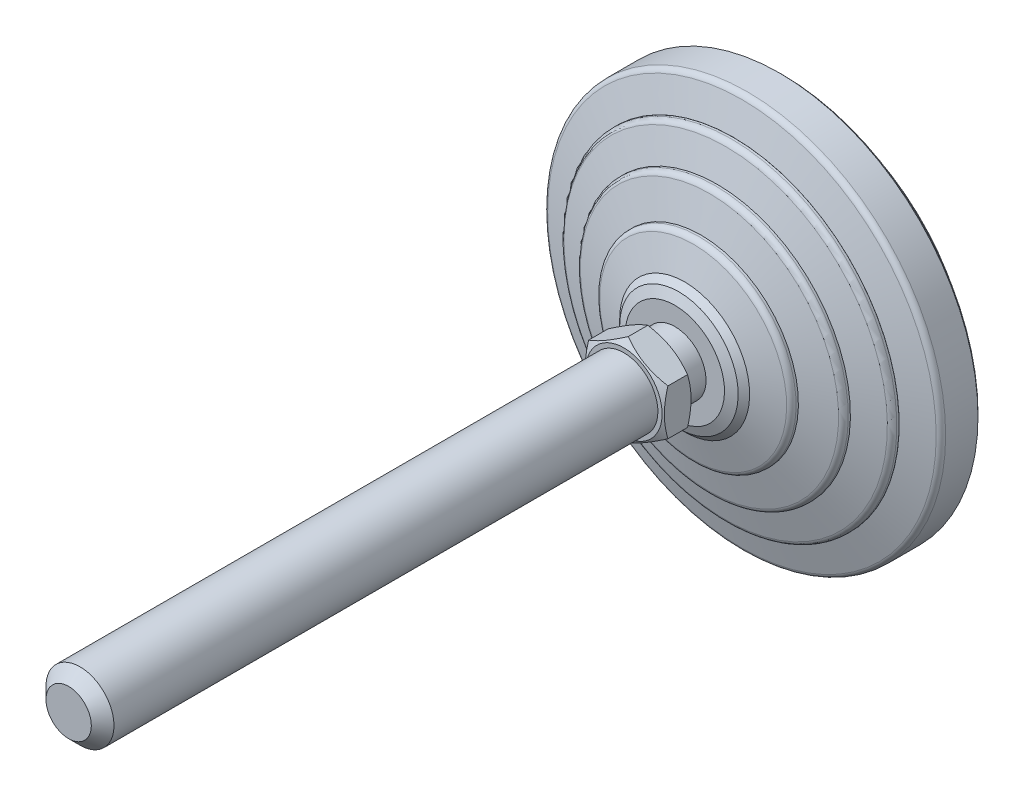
ISO-10303-21;
HEADER;
FILE_DESCRIPTION(('STEP AP214'),'2;1');
FILE_NAME('part.step','',(''),(''),'','','');
FILE_SCHEMA(('AUTOMOTIVE_DESIGN { 1 0 10303 214 1 1 1 1 }'));
ENDSEC;
DATA;
#1=APPLICATION_CONTEXT('core data for automotive mechanical design processes');
#2=APPLICATION_PROTOCOL_DEFINITION('international standard','automotive_design',2000,#1);
#3=PRODUCT_CONTEXT('',#1,'mechanical');
#4=PRODUCT('Part','Part','',(#3));
#5=PRODUCT_RELATED_PRODUCT_CATEGORY('part','',(#4));
#6=PRODUCT_DEFINITION_FORMATION('','',#4);
#7=PRODUCT_DEFINITION_CONTEXT('part definition',#1,'design');
#8=PRODUCT_DEFINITION('design','',#6,#7);
#9=PRODUCT_DEFINITION_SHAPE('','',#8);
#10=(LENGTH_UNIT() NAMED_UNIT(*) SI_UNIT(.MILLI.,.METRE.));
#11=(NAMED_UNIT(*) PLANE_ANGLE_UNIT() SI_UNIT($,.RADIAN.));
#12=(NAMED_UNIT(*) SI_UNIT($,.STERADIAN.) SOLID_ANGLE_UNIT());
#13=UNCERTAINTY_MEASURE_WITH_UNIT(LENGTH_MEASURE(1.E-05),#10,'distance_accuracy_value','');
#14=(GEOMETRIC_REPRESENTATION_CONTEXT(3) GLOBAL_UNCERTAINTY_ASSIGNED_CONTEXT((#13)) GLOBAL_UNIT_ASSIGNED_CONTEXT((#10,
#11,#12)) REPRESENTATION_CONTEXT('',''));
#15=CARTESIAN_POINT('',(0.,0.,0.));
#16=DIRECTION('',(0.,0.,1.));
#17=DIRECTION('',(1.,0.,0.));
#18=AXIS2_PLACEMENT_3D('',#15,#16,#17);
#19=CARTESIAN_POINT('',(-5.50000000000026,0.,26.));
#20=DIRECTION('',(0.,0.,1.));
#21=DIRECTION('',(0.,-1.,0.));
#22=AXIS2_PLACEMENT_3D('',#19,#20,#21);
#23=PLANE('',#22);
#24=CARTESIAN_POINT('',(0.,0.,26.));
#25=DIRECTION('',(0.,0.,-1.));
#26=DIRECTION('',(-1.,0.,0.));
#27=AXIS2_PLACEMENT_3D('',#24,#25,#26);
#28=CIRCLE('',#27,6.75);
#29=CARTESIAN_POINT('',(-6.75,0.,26.));
#30=VERTEX_POINT('',#29);
#31=EDGE_CURVE('E596',#30,#30,#28,.T.);
#32=ORIENTED_EDGE('',*,*,#31,.T.);
#33=EDGE_LOOP('',(#32));
#34=FACE_BOUND('',#33,.T.);
#35=CARTESIAN_POINT('',(0.,0.,26.));
#36=DIRECTION('',(0.,0.,-1.));
#37=DIRECTION('',(0.,1.,0.));
#38=AXIS2_PLACEMENT_3D('',#35,#36,#37);
#39=CIRCLE('',#38,5.50000000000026);
#40=CARTESIAN_POINT('',(0.,5.50000000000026,26.));
#41=VERTEX_POINT('',#40);
#42=EDGE_CURVE('E156',#41,#41,#39,.T.);
#43=ORIENTED_EDGE('',*,*,#42,.F.);
#44=EDGE_LOOP('',(#43));
#45=FACE_BOUND('',#44,.T.);
#46=ADVANCED_FACE('F14',(#34,#45),#23,.F.);
#47=CARTESIAN_POINT('',(0.,0.,0.));
#48=DIRECTION('',(0.,0.,-1.));
#49=DIRECTION('',(0.,1.,0.));
#50=AXIS2_PLACEMENT_3D('',#47,#48,#49);
#51=CYLINDRICAL_SURFACE('',#50,5.50000000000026);
#52=CARTESIAN_POINT('',(0.,0.,22.));
#53=DIRECTION('',(0.,0.,-1.));
#54=DIRECTION('',(0.,1.,0.));
#55=AXIS2_PLACEMENT_3D('',#52,#53,#54);
#56=CIRCLE('',#55,5.50000000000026);
#57=CARTESIAN_POINT('',(0.,5.50000000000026,22.));
#58=VERTEX_POINT('',#57);
#59=EDGE_CURVE('E153',#58,#58,#56,.T.);
#60=ORIENTED_EDGE('',*,*,#59,.F.);
#61=EDGE_LOOP('',(#60));
#62=FACE_BOUND('',#61,.T.);
#63=ORIENTED_EDGE('',*,*,#42,.T.);
#64=EDGE_LOOP('',(#63));
#65=FACE_BOUND('',#64,.T.);
#66=ADVANCED_FACE('F180',(#62,#65),#51,.T.);
#67=CARTESIAN_POINT('',(-8.75409836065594,0.,22.));
#68=DIRECTION('',(0.,0.,-1.));
#69=DIRECTION('',(0.,1.,0.));
#70=AXIS2_PLACEMENT_3D('',#67,#68,#69);
#71=PLANE('',#70);
#72=CARTESIAN_POINT('',(0.,0.,22.));
#73=DIRECTION('',(0.,0.,-1.));
#74=DIRECTION('',(0.,1.,0.));
#75=AXIS2_PLACEMENT_3D('',#72,#73,#74);
#76=CIRCLE('',#75,8.75409836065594);
#77=CARTESIAN_POINT('',(0.,8.75409836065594,22.));
#78=VERTEX_POINT('',#77);
#79=EDGE_CURVE('E150',#78,#78,#76,.T.);
#80=ORIENTED_EDGE('',*,*,#79,.F.);
#81=EDGE_LOOP('',(#80));
#82=FACE_BOUND('',#81,.T.);
#83=ORIENTED_EDGE('',*,*,#59,.T.);
#84=EDGE_LOOP('',(#83));
#85=FACE_BOUND('',#84,.T.);
#86=ADVANCED_FACE('F187',(#82,#85),#71,.F.);
#87=CARTESIAN_POINT('',(0.,0.,22.));
#88=DIRECTION('',(0.,0.,-1.));
#89=DIRECTION('',(0.,1.,0.));
#90=AXIS2_PLACEMENT_3D('',#87,#88,#89);
#91=CONICAL_SURFACE('',#90,8.75409836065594,1.17809724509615);
#92=CARTESIAN_POINT('',(0.,0.,21.2928932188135));
#93=DIRECTION('',(0.,0.,-1.));
#94=DIRECTION('',(0.,1.,0.));
#95=AXIS2_PLACEMENT_3D('',#92,#93,#94);
#96=CIRCLE('',#95,10.4612051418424);
#97=CARTESIAN_POINT('',(0.,10.4612051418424,21.2928932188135));
#98=VERTEX_POINT('',#97);
#99=EDGE_CURVE('E147',#98,#98,#96,.T.);
#100=ORIENTED_EDGE('',*,*,#99,.F.);
#101=EDGE_LOOP('',(#100));
#102=FACE_BOUND('',#101,.T.);
#103=ORIENTED_EDGE('',*,*,#79,.T.);
#104=EDGE_LOOP('',(#103));
#105=FACE_BOUND('',#104,.T.);
#106=ADVANCED_FACE('F459',(#102,#105),#91,.T.);
#107=CARTESIAN_POINT('',(0.,0.,21.2928932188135));
#108=DIRECTION('',(0.,0.,-1.));
#109=DIRECTION('',(0.,1.,0.));
#110=AXIS2_PLACEMENT_3D('',#107,#108,#109);
#111=CONICAL_SURFACE('',#110,10.4612051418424,0.785398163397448);
#112=CARTESIAN_POINT('',(0.,0.,20.2786885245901));
#113=DIRECTION('',(0.,0.,-1.));
#114=DIRECTION('',(0.,1.,0.));
#115=AXIS2_PLACEMENT_3D('',#112,#113,#114);
#116=CIRCLE('',#115,11.4754098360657);
#117=CARTESIAN_POINT('',(0.,11.4754098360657,20.2786885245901));
#118=VERTEX_POINT('',#117);
#119=EDGE_CURVE('E144',#118,#118,#116,.T.);
#120=ORIENTED_EDGE('',*,*,#119,.F.);
#121=EDGE_LOOP('',(#120));
#122=FACE_BOUND('',#121,.T.);
#123=ORIENTED_EDGE('',*,*,#99,.T.);
#124=EDGE_LOOP('',(#123));
#125=FACE_BOUND('',#124,.T.);
#126=ADVANCED_FACE('F449',(#122,#125),#111,.T.);
#127=CARTESIAN_POINT('',(0.,0.,20.2786885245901));
#128=DIRECTION('',(0.,0.,-1.));
#129=DIRECTION('',(0.,1.,0.));
#130=AXIS2_PLACEMENT_3D('',#127,#128,#129);
#131=CONICAL_SURFACE('',#130,11.4754098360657,1.27933953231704);
#132=CARTESIAN_POINT('',(0.,0.,18.7711726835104));
#133=DIRECTION('',(0.,0.,-1.));
#134=DIRECTION('',(0.,1.,0.));
#135=AXIS2_PLACEMENT_3D('',#132,#133,#134);
#136=CIRCLE('',#135,16.5004626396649);
#137=CARTESIAN_POINT('',(0.,16.5004626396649,18.7711726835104));
#138=VERTEX_POINT('',#137);
#139=EDGE_CURVE('E141',#138,#138,#136,.T.);
#140=ORIENTED_EDGE('',*,*,#139,.F.);
#141=EDGE_LOOP('',(#140));
#142=FACE_BOUND('',#141,.T.);
#143=ORIENTED_EDGE('',*,*,#119,.T.);
#144=EDGE_LOOP('',(#143));
#145=FACE_BOUND('',#144,.T.);
#146=ADVANCED_FACE('F439',(#142,#145),#131,.T.);
#147=CARTESIAN_POINT('',(0.,0.,17.8133463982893));
#148=DIRECTION('',(0.,0.,-1.));
#149=DIRECTION('',(0.,1.,0.));
#150=AXIS2_PLACEMENT_3D('',#147,#148,#149);
#151=TOROIDAL_SURFACE('',#150,16.2131147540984,1.);
#152=CARTESIAN_POINT('',(0.,0.,17.8133463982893));
#153=DIRECTION('',(0.,0.,-1.));
#154=DIRECTION('',(0.,1.,0.));
#155=AXIS2_PLACEMENT_3D('',#152,#153,#154);
#156=CIRCLE('',#155,17.2131147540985);
#157=CARTESIAN_POINT('',(0.,17.2131147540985,17.8133463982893));
#158=VERTEX_POINT('',#157);
#159=EDGE_CURVE('E138',#158,#158,#156,.T.);
#160=ORIENTED_EDGE('',*,*,#159,.F.);
#161=EDGE_LOOP('',(#160));
#162=FACE_BOUND('',#161,.T.);
#163=ORIENTED_EDGE('',*,*,#139,.T.);
#164=EDGE_LOOP('',(#163));
#165=FACE_BOUND('',#164,.T.);
#166=ADVANCED_FACE('F429',(#162,#165),#151,.T.);
#167=CARTESIAN_POINT('',(0.,0.,0.));
#168=DIRECTION('',(0.,0.,-1.));
#169=DIRECTION('',(0.,1.,0.));
#170=AXIS2_PLACEMENT_3D('',#167,#168,#169);
#171=CYLINDRICAL_SURFACE('',#170,17.2131147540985);
#172=CARTESIAN_POINT('',(0.,0.,17.4098360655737));
#173=DIRECTION('',(0.,0.,-1.));
#174=DIRECTION('',(0.,1.,0.));
#175=AXIS2_PLACEMENT_3D('',#172,#173,#174);
#176=CIRCLE('',#175,17.2131147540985);
#177=CARTESIAN_POINT('',(0.,17.2131147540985,17.4098360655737));
#178=VERTEX_POINT('',#177);
#179=EDGE_CURVE('E135',#178,#178,#176,.T.);
#180=ORIENTED_EDGE('',*,*,#179,.F.);
#181=EDGE_LOOP('',(#180));
#182=FACE_BOUND('',#181,.T.);
#183=ORIENTED_EDGE('',*,*,#159,.T.);
#184=EDGE_LOOP('',(#183));
#185=FACE_BOUND('',#184,.T.);
#186=ADVANCED_FACE('F419',(#182,#185),#171,.T.);
#187=CARTESIAN_POINT('',(0.,0.,17.4098360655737));
#188=DIRECTION('',(0.,0.,-1.));
#189=DIRECTION('',(0.,1.,0.));
#190=AXIS2_PLACEMENT_3D('',#187,#188,#189);
#191=CONICAL_SURFACE('',#190,17.2131147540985,1.30454427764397);
#192=CARTESIAN_POINT('',(0.,0.,15.8894925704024));
#193=DIRECTION('',(0.,0.,-1.));
#194=DIRECTION('',(0.,1.,0.));
#195=AXIS2_PLACEMENT_3D('',#192,#193,#194);
#196=CIRCLE('',#195,22.7877075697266);
#197=CARTESIAN_POINT('',(0.,22.7877075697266,15.8894925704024));
#198=VERTEX_POINT('',#197);
#199=EDGE_CURVE('E132',#198,#198,#196,.T.);
#200=ORIENTED_EDGE('',*,*,#199,.F.);
#201=EDGE_LOOP('',(#200));
#202=FACE_BOUND('',#201,.T.);
#203=ORIENTED_EDGE('',*,*,#179,.T.);
#204=EDGE_LOOP('',(#203));
#205=FACE_BOUND('',#204,.T.);
#206=ADVANCED_FACE('F409',(#202,#205),#191,.T.);
#207=CARTESIAN_POINT('',(0.,0.,14.9247287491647));
#208=DIRECTION('',(0.,0.,-1.));
#209=DIRECTION('',(0.,1.,0.));
#210=AXIS2_PLACEMENT_3D('',#207,#208,#209);
#211=TOROIDAL_SURFACE('',#210,22.5245901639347,0.999999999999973);
#212=CARTESIAN_POINT('',(0.,0.,14.9247287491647));
#213=DIRECTION('',(0.,0.,-1.));
#214=DIRECTION('',(0.,1.,0.));
#215=AXIS2_PLACEMENT_3D('',#212,#213,#214);
#216=CIRCLE('',#215,23.5245901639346);
#217=CARTESIAN_POINT('',(0.,23.5245901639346,14.9247287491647));
#218=VERTEX_POINT('',#217);
#219=EDGE_CURVE('E129',#218,#218,#216,.T.);
#220=ORIENTED_EDGE('',*,*,#219,.F.);
#221=EDGE_LOOP('',(#220));
#222=FACE_BOUND('',#221,.T.);
#223=ORIENTED_EDGE('',*,*,#199,.T.);
#224=EDGE_LOOP('',(#223));
#225=FACE_BOUND('',#224,.T.);
#226=ADVANCED_FACE('F399',(#222,#225),#211,.T.);
#227=CARTESIAN_POINT('',(0.,0.,0.));
#228=DIRECTION('',(0.,0.,-1.));
#229=DIRECTION('',(0.,1.,0.));
#230=AXIS2_PLACEMENT_3D('',#227,#228,#229);
#231=CYLINDRICAL_SURFACE('',#230,23.5245901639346);
#232=CARTESIAN_POINT('',(0.,0.,14.5409836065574));
#233=DIRECTION('',(0.,0.,-1.));
#234=DIRECTION('',(0.,1.,0.));
#235=AXIS2_PLACEMENT_3D('',#232,#233,#234);
#236=CIRCLE('',#235,23.5245901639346);
#237=CARTESIAN_POINT('',(0.,23.5245901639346,14.5409836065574));
#238=VERTEX_POINT('',#237);
#239=EDGE_CURVE('E126',#238,#238,#236,.T.);
#240=ORIENTED_EDGE('',*,*,#239,.F.);
#241=EDGE_LOOP('',(#240));
#242=FACE_BOUND('',#241,.T.);
#243=ORIENTED_EDGE('',*,*,#219,.T.);
#244=EDGE_LOOP('',(#243));
#245=FACE_BOUND('',#244,.T.);
#246=ADVANCED_FACE('F389',(#242,#245),#231,.T.);
#247=CARTESIAN_POINT('',(0.,0.,14.5409836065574));
#248=DIRECTION('',(0.,0.,-1.));
#249=DIRECTION('',(0.,1.,0.));
#250=AXIS2_PLACEMENT_3D('',#247,#248,#249);
#251=CONICAL_SURFACE('',#250,23.5245901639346,1.27871257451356);
#252=CARTESIAN_POINT('',(0.,0.,13.0337743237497));
#253=DIRECTION('',(0.,0.,-1.));
#254=DIRECTION('',(0.,1.,0.));
#255=AXIS2_PLACEMENT_3D('',#252,#253,#254);
#256=CIRCLE('',#255,28.5372004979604);
#257=CARTESIAN_POINT('',(0.,28.5372004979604,13.0337743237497));
#258=VERTEX_POINT('',#257);
#259=EDGE_CURVE('E123',#258,#258,#256,.T.);
#260=ORIENTED_EDGE('',*,*,#259,.F.);
#261=EDGE_LOOP('',(#260));
#262=FACE_BOUND('',#261,.T.);
#263=ORIENTED_EDGE('',*,*,#239,.T.);
#264=EDGE_LOOP('',(#263));
#265=FACE_BOUND('',#264,.T.);
#266=ADVANCED_FACE('F379',(#262,#265),#251,.T.);
#267=CARTESIAN_POINT('',(0.,0.,12.0761283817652));
#268=DIRECTION('',(0.,0.,-1.));
#269=DIRECTION('',(0.,1.,0.));
#270=AXIS2_PLACEMENT_3D('',#267,#268,#269);
#271=TOROIDAL_SURFACE('',#270,28.2492521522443,0.999999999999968);
#272=CARTESIAN_POINT('',(0.,0.,12.0761283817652));
#273=DIRECTION('',(0.,0.,-1.));
#274=DIRECTION('',(0.,1.,0.));
#275=AXIS2_PLACEMENT_3D('',#272,#273,#274);
#276=CIRCLE('',#275,29.2492521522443);
#277=CARTESIAN_POINT('',(0.,29.2492521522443,12.0761283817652));
#278=VERTEX_POINT('',#277);
#279=EDGE_CURVE('E120',#278,#278,#276,.T.);
#280=ORIENTED_EDGE('',*,*,#279,.F.);
#281=EDGE_LOOP('',(#280));
#282=FACE_BOUND('',#281,.T.);
#283=ORIENTED_EDGE('',*,*,#259,.T.);
#284=EDGE_LOOP('',(#283));
#285=FACE_BOUND('',#284,.T.);
#286=ADVANCED_FACE('F369',(#282,#285),#271,.T.);
#287=CARTESIAN_POINT('',(0.,0.,0.));
#288=DIRECTION('',(0.,0.,-1.));
#289=DIRECTION('',(0.,1.,0.));
#290=AXIS2_PLACEMENT_3D('',#287,#288,#289);
#291=CYLINDRICAL_SURFACE('',#290,29.2492521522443);
#292=CARTESIAN_POINT('',(0.,0.,11.672131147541));
#293=DIRECTION('',(0.,0.,-1.));
#294=DIRECTION('',(0.,1.,0.));
#295=AXIS2_PLACEMENT_3D('',#292,#293,#294);
#296=CIRCLE('',#295,29.2492521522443);
#297=CARTESIAN_POINT('',(0.,29.2492521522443,11.672131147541));
#298=VERTEX_POINT('',#297);
#299=EDGE_CURVE('E117',#298,#298,#296,.T.);
#300=ORIENTED_EDGE('',*,*,#299,.F.);
#301=EDGE_LOOP('',(#300));
#302=FACE_BOUND('',#301,.T.);
#303=ORIENTED_EDGE('',*,*,#279,.T.);
#304=EDGE_LOOP('',(#303));
#305=FACE_BOUND('',#304,.T.);
#306=ADVANCED_FACE('F359',(#302,#305),#291,.T.);
#307=CARTESIAN_POINT('',(-29.2622950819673,0.,11.672131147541));
#308=DIRECTION('',(0.,0.,-1.));
#309=DIRECTION('',(0.,1.,0.));
#310=AXIS2_PLACEMENT_3D('',#307,#308,#309);
#311=PLANE('',#310);
#312=CARTESIAN_POINT('',(0.,0.,11.672131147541));
#313=DIRECTION('',(0.,0.,-1.));
#314=DIRECTION('',(0.,1.,0.));
#315=AXIS2_PLACEMENT_3D('',#312,#313,#314);
#316=CIRCLE('',#315,29.2622950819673);
#317=CARTESIAN_POINT('',(0.,29.2622950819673,11.672131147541));
#318=VERTEX_POINT('',#317);
#319=EDGE_CURVE('E114',#318,#318,#316,.T.);
#320=ORIENTED_EDGE('',*,*,#319,.F.);
#321=EDGE_LOOP('',(#320));
#322=FACE_BOUND('',#321,.T.);
#323=ORIENTED_EDGE('',*,*,#299,.T.);
#324=EDGE_LOOP('',(#323));
#325=FACE_BOUND('',#324,.T.);
#326=ADVANCED_FACE('F349',(#322,#325),#311,.F.);
#327=CARTESIAN_POINT('',(0.,0.,11.672131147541));
#328=DIRECTION('',(0.,0.,-1.));
#329=DIRECTION('',(0.,1.,0.));
#330=AXIS2_PLACEMENT_3D('',#327,#328,#329);
#331=CONICAL_SURFACE('',#330,29.2622950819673,1.27933953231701);
#332=CARTESIAN_POINT('',(0.,0.,10.1646153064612));
#333=DIRECTION('',(0.,0.,-1.));
#334=DIRECTION('',(0.,1.,0.));
#335=AXIS2_PLACEMENT_3D('',#332,#333,#334);
#336=CIRCLE('',#335,34.2873478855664);
#337=CARTESIAN_POINT('',(0.,34.2873478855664,10.1646153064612));
#338=VERTEX_POINT('',#337);
#339=EDGE_CURVE('E111',#338,#338,#336,.T.);
#340=ORIENTED_EDGE('',*,*,#339,.F.);
#341=EDGE_LOOP('',(#340));
#342=FACE_BOUND('',#341,.T.);
#343=ORIENTED_EDGE('',*,*,#319,.T.);
#344=EDGE_LOOP('',(#343));
#345=FACE_BOUND('',#344,.T.);
#346=ADVANCED_FACE('F339',(#342,#345),#331,.T.);
#347=CARTESIAN_POINT('',(0.,0.,9.20678902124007));
#348=DIRECTION('',(0.,0.,-1.));
#349=DIRECTION('',(0.,1.,0.));
#350=AXIS2_PLACEMENT_3D('',#347,#348,#349);
#351=TOROIDAL_SURFACE('',#350,34.,0.999999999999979);
#352=CARTESIAN_POINT('',(0.,0.,9.20678902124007));
#353=DIRECTION('',(0.,0.,-1.));
#354=DIRECTION('',(0.,1.,0.));
#355=AXIS2_PLACEMENT_3D('',#352,#353,#354);
#356=CIRCLE('',#355,35.);
#357=CARTESIAN_POINT('',(0.,35.,9.20678902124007));
#358=VERTEX_POINT('',#357);
#359=EDGE_CURVE('E108',#358,#358,#356,.T.);
#360=ORIENTED_EDGE('',*,*,#359,.F.);
#361=EDGE_LOOP('',(#360));
#362=FACE_BOUND('',#361,.T.);
#363=ORIENTED_EDGE('',*,*,#339,.T.);
#364=EDGE_LOOP('',(#363));
#365=FACE_BOUND('',#364,.T.);
#366=ADVANCED_FACE('F329',(#362,#365),#351,.T.);
#367=CARTESIAN_POINT('',(0.,0.,0.));
#368=DIRECTION('',(0.,0.,-1.));
#369=DIRECTION('',(0.,1.,0.));
#370=AXIS2_PLACEMENT_3D('',#367,#368,#369);
#371=CYLINDRICAL_SURFACE('',#370,35.);
#372=CARTESIAN_POINT('',(0.,0.,3.5));
#373=DIRECTION('',(0.,0.,-1.));
#374=DIRECTION('',(0.,1.,0.));
#375=AXIS2_PLACEMENT_3D('',#372,#373,#374);
#376=CIRCLE('',#375,35.);
#377=CARTESIAN_POINT('',(0.,35.,3.5));
#378=VERTEX_POINT('',#377);
#379=EDGE_CURVE('E105',#378,#378,#376,.T.);
#380=ORIENTED_EDGE('',*,*,#379,.F.);
#381=EDGE_LOOP('',(#380));
#382=FACE_BOUND('',#381,.T.);
#383=ORIENTED_EDGE('',*,*,#359,.T.);
#384=EDGE_LOOP('',(#383));
#385=FACE_BOUND('',#384,.T.);
#386=ADVANCED_FACE('F319',(#382,#385),#371,.T.);
#387=CARTESIAN_POINT('',(0.,0.,3.5));
#388=DIRECTION('',(0.,0.,1.));
#389=DIRECTION('',(0.,-1.,0.));
#390=AXIS2_PLACEMENT_3D('',#387,#388,#389);
#391=CONICAL_SURFACE('',#390,35.,0.785398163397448);
#392=CARTESIAN_POINT('',(0.,0.,3.));
#393=DIRECTION('',(0.,0.,-1.));
#394=DIRECTION('',(0.,1.,0.));
#395=AXIS2_PLACEMENT_3D('',#392,#393,#394);
#396=CIRCLE('',#395,34.5);
#397=CARTESIAN_POINT('',(0.,34.5,3.));
#398=VERTEX_POINT('',#397);
#399=EDGE_CURVE('E102',#398,#398,#396,.T.);
#400=ORIENTED_EDGE('',*,*,#399,.F.);
#401=EDGE_LOOP('',(#400));
#402=FACE_BOUND('',#401,.T.);
#403=ORIENTED_EDGE('',*,*,#379,.T.);
#404=EDGE_LOOP('',(#403));
#405=FACE_BOUND('',#404,.T.);
#406=ADVANCED_FACE('F309',(#402,#405),#391,.T.);
#407=CARTESIAN_POINT('',(-34.5,0.,3.));
#408=DIRECTION('',(0.,0.,1.));
#409=DIRECTION('',(0.,-1.,0.));
#410=AXIS2_PLACEMENT_3D('',#407,#408,#409);
#411=PLANE('',#410);
#412=CARTESIAN_POINT('',(0.,0.,3.));
#413=DIRECTION('',(0.,0.,-1.));
#414=DIRECTION('',(0.,1.,0.));
#415=AXIS2_PLACEMENT_3D('',#412,#413,#414);
#416=CIRCLE('',#415,30.4098360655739);
#417=CARTESIAN_POINT('',(0.,30.4098360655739,3.));
#418=VERTEX_POINT('',#417);
#419=EDGE_CURVE('E99',#418,#418,#416,.T.);
#420=ORIENTED_EDGE('',*,*,#419,.F.);
#421=EDGE_LOOP('',(#420));
#422=FACE_BOUND('',#421,.T.);
#423=ORIENTED_EDGE('',*,*,#399,.T.);
#424=EDGE_LOOP('',(#423));
#425=FACE_BOUND('',#424,.T.);
#426=ADVANCED_FACE('F299',(#422,#425),#411,.F.);
#427=CARTESIAN_POINT('',(0.,0.,0.));
#428=DIRECTION('',(0.,0.,-1.));
#429=DIRECTION('',(0.,1.,0.));
#430=AXIS2_PLACEMENT_3D('',#427,#428,#429);
#431=CYLINDRICAL_SURFACE('',#430,30.4098360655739);
#432=CARTESIAN_POINT('',(0.,0.,0.));
#433=DIRECTION('',(0.,0.,-1.));
#434=DIRECTION('',(0.,1.,0.));
#435=AXIS2_PLACEMENT_3D('',#432,#433,#434);
#436=CIRCLE('',#435,30.4098360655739);
#437=CARTESIAN_POINT('',(0.,30.4098360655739,0.));
#438=VERTEX_POINT('',#437);
#439=EDGE_CURVE('E96',#438,#438,#436,.T.);
#440=ORIENTED_EDGE('',*,*,#439,.F.);
#441=EDGE_LOOP('',(#440));
#442=FACE_BOUND('',#441,.T.);
#443=ORIENTED_EDGE('',*,*,#419,.T.);
#444=EDGE_LOOP('',(#443));
#445=FACE_BOUND('',#444,.T.);
#446=ADVANCED_FACE('F288',(#442,#445),#431,.T.);
#447=CARTESIAN_POINT('',(-30.4098360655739,0.,0.));
#448=DIRECTION('',(0.,0.,1.));
#449=DIRECTION('',(0.,-1.,0.));
#450=AXIS2_PLACEMENT_3D('',#447,#448,#449);
#451=PLANE('',#450);
#452=ORIENTED_EDGE('',*,*,#439,.T.);
#453=EDGE_LOOP('',(#452));
#454=FACE_BOUND('',#453,.T.);
#455=ADVANCED_FACE('F178',(#454),#451,.F.);
#456=CARTESIAN_POINT('',(0.,0.,27.3670987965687));
#457=DIRECTION('',(0.,0.,1.));
#458=DIRECTION('',(1.,0.,0.));
#459=AXIS2_PLACEMENT_3D('',#456,#457,#458);
#460=CONICAL_SURFACE('',#459,9.11788457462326,1.0471975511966);
#461=CARTESIAN_POINT('',(0.258039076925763,-8.2318826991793,26.8578997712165));
#462=CARTESIAN_POINT('',(-0.0686240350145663,-8.04328366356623,26.7431437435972));
#463=CARTESIAN_POINT('',(-0.398342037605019,-7.85292088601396,26.6381100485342));
#464=CARTESIAN_POINT('',(-1.06415897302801,-7.46851129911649,26.4537027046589));
#465=CARTESIAN_POINT('',(-1.40027478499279,-7.27445474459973,26.3744112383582));
#466=CARTESIAN_POINT('',(-1.90303041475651,-6.98418864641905,26.280889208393));
#467=CARTESIAN_POINT('',(-2.06792169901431,-6.88898861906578,26.2541713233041));
#468=CARTESIAN_POINT('',(-2.39856793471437,-6.69808992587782,26.2090862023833));
#469=CARTESIAN_POINT('',(-2.56432289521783,-6.60239125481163,26.1907190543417));
#470=CARTESIAN_POINT('',(-2.89612661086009,-6.41082429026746,26.1628595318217));
#471=CARTESIAN_POINT('',(-3.06217445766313,-6.31495652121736,26.1533528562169));
#472=CARTESIAN_POINT('',(-3.39447483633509,-6.12310280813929,26.1434349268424));
#473=CARTESIAN_POINT('',(-3.56072736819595,-6.02711686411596,26.1430236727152));
#474=CARTESIAN_POINT('',(-3.90340801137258,-5.82927010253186,26.1515689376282));
#475=CARTESIAN_POINT('',(-4.07982528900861,-5.727415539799,26.1611102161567));
#476=CARTESIAN_POINT('',(-4.43204146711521,-5.52406343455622,26.1901640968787));
#477=CARTESIAN_POINT('',(-4.60784034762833,-5.42256590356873,26.2096770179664));
#478=CARTESIAN_POINT('',(-4.95878832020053,-5.21994599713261,26.2581248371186));
#479=CARTESIAN_POINT('',(-5.13393556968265,-5.11882468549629,26.2870773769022));
#480=CARTESIAN_POINT('',(-5.48300094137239,-4.91729169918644,26.3536010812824));
#481=CARTESIAN_POINT('',(-5.6569189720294,-4.81688007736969,26.3911728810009));
#482=CARTESIAN_POINT('',(-6.00889155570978,-4.61366861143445,26.4753595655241));
#483=CARTESIAN_POINT('',(-6.18690088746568,-4.51089487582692,26.5222248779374));
#484=CARTESIAN_POINT('',(-6.54138704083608,-4.30623219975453,26.6231781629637));
#485=CARTESIAN_POINT('',(-6.71786369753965,-4.20434335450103,26.6772669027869));
#486=CARTESIAN_POINT('',(-7.06855131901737,-4.0018737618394,26.7914636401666));
#487=CARTESIAN_POINT('',(-7.2427686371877,-3.90128934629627,26.8515458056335));
#488=CARTESIAN_POINT('',(-7.5896850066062,-3.70099708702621,26.977053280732));
#489=CARTESIAN_POINT('',(-7.76238460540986,-3.60128892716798,27.0424765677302));
#490=CARTESIAN_POINT('',(-7.93439481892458,-3.50197878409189,27.1101629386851));
#491=B_SPLINE_CURVE_WITH_KNOTS('',3,(#461,#462,#463,#464,#465,#466,#467,#468,#469,#470,#471,
#472,#473,#474,#475,#476,#477,#478,#479,#480,#481,#482,#483,#484,#485,#486,#487,#488,#489,#490),
.UNSPECIFIED.,.F.,.F.,(4,2,2,2,2,2,2,2,2,2,2,2,2,2,4),(0.,1.18354906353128,2.37084029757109,
2.94746793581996,3.52410163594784,4.09980300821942,4.67550435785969,5.2870444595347,
5.89860411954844,6.51131333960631,7.12406772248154,7.75638618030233,8.38877185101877,
9.0185408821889,9.64807252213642),.UNSPECIFIED.);
#492=CARTESIAN_POINT('',(0.,-8.08290376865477,26.7695523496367));
#493=VERTEX_POINT('',#492);
#494=CARTESIAN_POINT('',(-7.,-4.04145188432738,26.7695523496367));
#495=VERTEX_POINT('',#494);
#496=EDGE_CURVE('E73',#493,#495,#491,.T.);
#497=ORIENTED_EDGE('',*,*,#496,.T.);
#498=CARTESIAN_POINT('',(-7.,-10.7815147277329,29.5244996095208));
#499=CARTESIAN_POINT('',(-7.,-10.4763919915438,29.3767881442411));
#500=CARTESIAN_POINT('',(-7.,-10.1705607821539,29.2305146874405));
#501=CARTESIAN_POINT('',(-7.,-9.55710434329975,28.9416541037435));
#502=CARTESIAN_POINT('',(-7.,-9.24947883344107,28.7990675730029));
#503=CARTESIAN_POINT('',(-7.,-8.63043578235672,28.5176578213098));
#504=CARTESIAN_POINT('',(-7.,-8.31900666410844,28.3788599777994));
#505=CARTESIAN_POINT('',(-7.,-7.69364527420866,28.1070446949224));
#506=CARTESIAN_POINT('',(-7.,-7.37971312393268,27.9740269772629));
#507=CARTESIAN_POINT('',(-7.,-6.73900835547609,27.7112659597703));
#508=CARTESIAN_POINT('',(-7.,-6.41214041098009,27.5817537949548));
#509=CARTESIAN_POINT('',(-7.,-5.75455383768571,27.3327126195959));
#510=CARTESIAN_POINT('',(-7.,-5.42383477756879,27.2131847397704));
#511=CARTESIAN_POINT('',(-7.,-4.75865923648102,26.9873049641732));
#512=CARTESIAN_POINT('',(-7.,-4.42421213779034,26.8809257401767));
#513=CARTESIAN_POINT('',(-7.,-3.75053369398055,26.6848041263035));
#514=CARTESIAN_POINT('',(-7.,-3.41130391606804,26.5950564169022));
#515=CARTESIAN_POINT('',(-7.,-2.72967662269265,26.437032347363));
#516=CARTESIAN_POINT('',(-7.,-2.38730614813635,26.3686425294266));
#517=CARTESIAN_POINT('',(-7.,-1.87069307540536,26.2850743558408));
#518=CARTESIAN_POINT('',(-7.,-1.69796589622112,26.2603865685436));
#519=CARTESIAN_POINT('',(-7.,-1.35167852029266,26.217835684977));
#520=CARTESIAN_POINT('',(-7.,-1.17811840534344,26.1999719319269));
#521=CARTESIAN_POINT('',(-7.,-0.832632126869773,26.1716452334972));
#522=CARTESIAN_POINT('',(-7.,-0.660713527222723,26.1610903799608));
#523=CARTESIAN_POINT('',(-7.,-0.316584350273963,26.1472548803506));
#524=CARTESIAN_POINT('',(-7.,-0.144373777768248,26.143974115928));
#525=CARTESIAN_POINT('',(-7.,0.200032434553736,26.1447648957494));
#526=CARTESIAN_POINT('',(-7.,0.372228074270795,26.1488364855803));
#527=CARTESIAN_POINT('',(-7.,0.716297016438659,26.1642337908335));
#528=CARTESIAN_POINT('',(-7.,0.888170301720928,26.1755598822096));
#529=CARTESIAN_POINT('',(-7.,1.30351412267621,26.2114587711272));
#530=CARTESIAN_POINT('',(-7.,1.54668249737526,26.2396000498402));
#531=CARTESIAN_POINT('',(-7.,2.03115378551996,26.3088509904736));
#532=CARTESIAN_POINT('',(-7.,2.27245643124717,26.3499624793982));
#533=CARTESIAN_POINT('',(-7.,2.99332400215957,26.4905670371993));
#534=CARTESIAN_POINT('',(-7.,3.46956688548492,26.6073026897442));
#535=CARTESIAN_POINT('',(-7.,4.18158176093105,26.808966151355));
#536=CARTESIAN_POINT('',(-7.,4.4210659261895,26.8815346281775));
#537=CARTESIAN_POINT('',(-7.,4.89770700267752,27.0340175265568));
#538=CARTESIAN_POINT('',(-7.,5.13486389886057,27.1139319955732));
#539=CARTESIAN_POINT('',(-7.,5.606928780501,27.2798406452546));
#540=CARTESIAN_POINT('',(-7.,5.84183752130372,27.365832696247));
#541=CARTESIAN_POINT('',(-7.,6.30972167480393,27.5429038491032));
#542=CARTESIAN_POINT('',(-7.,6.54269710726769,27.6339828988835));
#543=CARTESIAN_POINT('',(-7.,7.08039694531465,27.8498774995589));
#544=CARTESIAN_POINT('',(-7.,7.38449568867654,27.9762481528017));
#545=CARTESIAN_POINT('',(-7.,7.99021045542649,28.2348218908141));
#546=CARTESIAN_POINT('',(-7.,8.29182634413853,28.3670252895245));
#547=CARTESIAN_POINT('',(-7.,8.89301663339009,28.6361263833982));
#548=CARTESIAN_POINT('',(-7.,9.19259065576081,28.7730249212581));
#549=CARTESIAN_POINT('',(-7.,9.78998433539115,29.0506042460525));
#550=CARTESIAN_POINT('',(-7.,10.0878039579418,29.191285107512));
#551=CARTESIAN_POINT('',(-7.,10.6822549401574,29.47587561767));
#552=CARTESIAN_POINT('',(-7.,10.9788848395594,29.6197883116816));
#553=CARTESIAN_POINT('',(-7.,11.5708905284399,29.9101727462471));
#554=CARTESIAN_POINT('',(-7.,11.8662663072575,30.0566445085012));
#555=CARTESIAN_POINT('',(-7.,12.7507335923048,30.4991997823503));
#556=CARTESIAN_POINT('',(-7.,13.3382365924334,30.7984578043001));
#557=CARTESIAN_POINT('',(-7.,14.4630225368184,31.3786750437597));
#558=CARTESIAN_POINT('',(-7.,15.0005454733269,31.6591710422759));
#559=CARTESIAN_POINT('',(-7.,16.0735853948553,32.224012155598));
#560=CARTESIAN_POINT('',(-7.,16.6091023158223,32.5083573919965));
#561=CARTESIAN_POINT('',(-7.,17.6773233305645,33.0793298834));
#562=CARTESIAN_POINT('',(-7.,18.2100310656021,33.3659503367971));
#563=CARTESIAN_POINT('',(-7.,19.2741567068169,33.9415116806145));
#564=CARTESIAN_POINT('',(-7.,19.8055746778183,34.2304524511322));
#565=CARTESIAN_POINT('',(-7.,20.3365143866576,34.5202635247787));
#566=B_SPLINE_CURVE_WITH_KNOTS('',3,(#498,#499,#500,#501,#502,#503,#504,#505,#506,#507,#508,
#509,#510,#511,#512,#513,#514,#515,#516,#517,#518,#519,#520,#521,#522,#523,#524,#525,#526,#527,
#528,#529,#530,#531,#532,#533,#534,#535,#536,#537,#538,#539,#540,#541,#542,#543,#544,#545,#546,
#547,#548,#549,#550,#551,#552,#553,#554,#555,#556,#557,#558,#559,#560,#561,#562,#563,#564,#565),
.UNSPECIFIED.,.F.,.F.,(4,2,2,2,2,2,2,2,2,2,2,2,2,2,2,2,2,2,2,2,2,2,2,2,2,2,2,2,2,2,2,2,2,4),(0.,
1.01700199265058,2.03416741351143,3.05699693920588,4.07977716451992,5.13442290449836,
6.1891879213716,7.24172246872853,8.29391978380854,9.34042858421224,9.86376264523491,
10.3870463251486,10.9036240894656,11.4201934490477,11.9367660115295,12.4533653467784,
13.1873230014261,13.9213840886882,15.3903515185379,16.141004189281,16.8916617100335,
17.6420574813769,18.3924455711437,19.3802971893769,20.368202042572,21.3562851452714,
22.3443877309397,23.3334640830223,24.3225488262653,26.3004800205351,28.1193861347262,
29.9383498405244,31.7531052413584,33.5677674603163),.UNSPECIFIED.);
#567=CARTESIAN_POINT('',(-7.,4.04145188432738,26.7695523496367));
#568=VERTEX_POINT('',#567);
#569=EDGE_CURVE('E81',#495,#568,#566,.T.);
#570=ORIENTED_EDGE('',*,*,#569,.T.);
#571=CARTESIAN_POINT('',(-12.6548322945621,0.776632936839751,29.4229025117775));
#572=CARTESIAN_POINT('',(-12.386887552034,0.931330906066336,29.2740122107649));
#573=CARTESIAN_POINT('',(-12.1182882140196,1.08640680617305,29.126662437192));
#574=CARTESIAN_POINT('',(-11.5794198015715,1.39752262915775,28.8359408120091));
#575=CARTESIAN_POINT('',(-11.3091504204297,1.55356272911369,28.6925697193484));
#576=CARTESIAN_POINT('',(-10.7649682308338,1.86774646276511,28.409868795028));
#577=CARTESIAN_POINT('',(-10.4910431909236,2.02589715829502,28.2705702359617));
#578=CARTESIAN_POINT('',(-9.94085656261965,2.34354755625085,27.9982932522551));
#579=CARTESIAN_POINT('',(-9.66459510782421,2.50304718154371,27.8653144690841));
#580=CARTESIAN_POINT('',(-9.10680837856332,2.82508549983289,27.6062544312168));
#581=CARTESIAN_POINT('',(-8.8252581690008,2.98763858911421,27.4802443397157));
#582=CARTESIAN_POINT('',(-8.25873320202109,3.31472193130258,27.2387331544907));
#583=CARTESIAN_POINT('',(-7.97375804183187,3.47925241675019,27.1232333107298));
#584=CARTESIAN_POINT('',(-7.40059353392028,3.81016909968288,26.9060871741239));
#585=CARTESIAN_POINT('',(-7.11241360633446,3.9765498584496,26.8044081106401));
#586=CARTESIAN_POINT('',(-6.53193080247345,4.31169176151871,26.6184322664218));
#587=CARTESIAN_POINT('',(-6.23962938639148,4.48045206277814,26.5341294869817));
#588=CARTESIAN_POINT('',(-5.65454869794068,4.81824855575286,26.3882406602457));
#589=CARTESIAN_POINT('',(-5.36182199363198,4.98725439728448,26.3263813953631));
#590=CARTESIAN_POINT('',(-4.92034572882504,5.2421408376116,26.2526927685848));
#591=CARTESIAN_POINT('',(-4.77276970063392,5.32734389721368,26.2313117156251));
#592=CARTESIAN_POINT('',(-4.47700281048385,5.4981049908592,26.1953402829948));
#593=CARTESIAN_POINT('',(-4.32881200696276,5.58366299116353,26.1807492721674));
#594=CARTESIAN_POINT('',(-4.03284564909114,5.75453924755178,26.1587409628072));
#595=CARTESIAN_POINT('',(-3.88507227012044,5.83985624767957,26.1512847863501));
#596=CARTESIAN_POINT('',(-3.58938557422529,6.01057104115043,26.1435769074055));
#597=CARTESIAN_POINT('',(-3.44147225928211,6.0959688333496,26.1433251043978));
#598=CARTESIAN_POINT('',(-3.14580514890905,6.26667231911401,26.1500318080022));
#599=CARTESIAN_POINT('',(-2.99805132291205,6.35197803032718,26.1569885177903));
#600=CARTESIAN_POINT('',(-2.70291663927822,6.52237411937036,26.1779480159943));
#601=CARTESIAN_POINT('',(-2.55553580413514,6.60746448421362,26.1919512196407));
#602=CARTESIAN_POINT('',(-2.19127256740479,6.81777196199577,26.2349890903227));
#603=CARTESIAN_POINT('',(-1.97473690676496,6.94278888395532,26.2680068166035));
#604=CARTESIAN_POINT('',(-1.54351026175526,7.19175770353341,26.3473517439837));
#605=CARTESIAN_POINT('',(-1.32881958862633,7.3157094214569,26.3936811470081));
#606=CARTESIAN_POINT('',(-0.68706551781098,7.68622630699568,26.5502923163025));
#607=CARTESIAN_POINT('',(-0.263177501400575,7.93095816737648,26.6780833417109));
#608=CARTESIAN_POINT('',(0.37048932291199,8.29680587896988,26.8962634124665));
#609=CARTESIAN_POINT('',(0.583620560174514,8.41985725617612,26.974390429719));
#610=CARTESIAN_POINT('',(1.00782553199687,8.66477211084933,27.1378983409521));
#611=CARTESIAN_POINT('',(1.21889908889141,8.78663548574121,27.2232798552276));
#612=CARTESIAN_POINT('',(1.63792930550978,9.02856269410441,27.399508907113));
#613=CARTESIAN_POINT('',(1.84589692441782,9.14863285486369,27.4903220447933));
#614=CARTESIAN_POINT('',(2.26009786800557,9.38777188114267,27.676858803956));
#615=CARTESIAN_POINT('',(2.46633174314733,9.50684106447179,27.7725807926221));
#616=CARTESIAN_POINT('',(2.67184121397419,9.62549201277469,27.8702892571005));
#617=B_SPLINE_CURVE_WITH_KNOTS('',3,(#571,#572,#573,#574,#575,#576,#577,#578,#579,#580,#581,
#582,#583,#584,#585,#586,#587,#588,#589,#590,#591,#592,#593,#594,#595,#596,#597,#598,#599,#600,
#601,#602,#603,#604,#605,#606,#607,#608,#609,#610,#611,#612,#613,#614,#615,#616),.UNSPECIFIED.,
.F.,.F.,(4,2,2,2,2,2,2,2,2,2,2,2,2,2,2,2,2,2,2,2,2,2,4),(0.,1.03008688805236,2.06036893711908,
3.09716329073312,4.13389875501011,5.17977623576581,6.22577793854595,7.26925449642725,
8.31237021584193,9.34232389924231,9.85743629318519,10.3725007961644,10.8847424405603,
11.3969769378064,11.9090837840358,12.4212208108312,13.1773989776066,13.9337022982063,
15.4492856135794,16.2238511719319,16.9984830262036,17.7686430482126,18.5385485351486),.UNSPECIFIED.);
#618=CARTESIAN_POINT('',(0.,8.08290376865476,26.7695523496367));
#619=VERTEX_POINT('',#618);
#620=EDGE_CURVE('E551',#568,#619,#617,.T.);
#621=ORIENTED_EDGE('',*,*,#620,.T.);
#622=CARTESIAN_POINT('',(-0.94029395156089,8.62578273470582,27.1124858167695));
#623=CARTESIAN_POINT('',(-0.768199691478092,8.52642406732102,27.0447077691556));
#624=CARTESIAN_POINT('',(-0.595415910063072,8.42666730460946,26.9791913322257));
#625=CARTESIAN_POINT('',(-0.248330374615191,8.2262773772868,26.8534949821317));
#626=CARTESIAN_POINT('',(-0.0740280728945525,8.12564389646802,26.7933170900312));
#627=CARTESIAN_POINT('',(0.276832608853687,7.92307438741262,26.6789258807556));
#628=CARTESIAN_POINT('',(0.453397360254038,7.82113468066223,26.6247384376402));
#629=CARTESIAN_POINT('',(0.808061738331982,7.61636910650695,26.5235866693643));
#630=CARTESIAN_POINT('',(0.986161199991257,7.51354333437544,26.4766215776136));
#631=CARTESIAN_POINT('',(1.33831110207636,7.31022949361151,26.3922396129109));
#632=CARTESIAN_POINT('',(1.51231621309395,7.20976759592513,26.3545721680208));
#633=CARTESIAN_POINT('',(1.86155893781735,7.00813221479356,26.2878594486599));
#634=CARTESIAN_POINT('',(2.03679645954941,6.90695878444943,26.2588135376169));
#635=CARTESIAN_POINT('',(2.38792810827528,6.70423283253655,26.210184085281));
#636=CARTESIAN_POINT('',(2.56382038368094,6.60268137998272,26.1905828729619));
#637=CARTESIAN_POINT('',(2.91622708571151,6.39921927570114,26.161360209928));
#638=CARTESIAN_POINT('',(3.09274149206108,6.29730863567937,26.1517384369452));
#639=CARTESIAN_POINT('',(3.43544821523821,6.09944681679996,26.1430514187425));
#640=CARTESIAN_POINT('',(3.60162933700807,6.0035021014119,26.1433917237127));
#641=CARTESIAN_POINT('',(3.93379001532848,5.8117290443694,26.1531610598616));
#642=CARTESIAN_POINT('',(4.09976957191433,5.71590070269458,26.1625900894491));
#643=CARTESIAN_POINT('',(4.43143940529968,5.52441103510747,26.1902898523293));
#644=CARTESIAN_POINT('',(4.59712878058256,5.42875022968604,26.2085748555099));
#645=CARTESIAN_POINT('',(4.92764690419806,5.23792550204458,26.2534935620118));
#646=CARTESIAN_POINT('',(5.09247566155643,5.14276157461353,26.2801271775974));
#647=CARTESIAN_POINT('',(5.59503705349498,4.8526076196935,26.3733902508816));
#648=CARTESIAN_POINT('',(5.93102547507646,4.65862461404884,26.4525064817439));
#649=CARTESIAN_POINT('',(6.5965973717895,4.27435650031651,26.6365729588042));
#650=CARTESIAN_POINT('',(6.92619765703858,4.08406168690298,26.7414412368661));
#651=CARTESIAN_POINT('',(7.25274364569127,3.89553027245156,26.856040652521));
#652=B_SPLINE_CURVE_WITH_KNOTS('',3,(#622,#623,#624,#625,#626,#627,#628,#629,#630,#631,#632,
#633,#634,#635,#636,#637,#638,#639,#640,#641,#642,#643,#644,#645,#646,#647,#648,#649,#650,#651),
.UNSPECIFIED.,.F.,.F.,(4,2,2,2,2,2,2,2,2,2,2,2,2,2,4),(0.,0.629895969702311,1.26002939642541,
1.89278612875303,2.52547565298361,3.13857938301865,3.75163783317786,4.36354475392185,
4.97543191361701,5.55088578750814,6.12633956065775,6.70272367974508,7.27910174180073,
8.46585468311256,9.64887809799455),.UNSPECIFIED.);
#653=CARTESIAN_POINT('',(7.,4.04145188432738,26.7695523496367));
#654=VERTEX_POINT('',#653);
#655=EDGE_CURVE('E546',#619,#654,#652,.T.);
#656=ORIENTED_EDGE('',*,*,#655,.T.);
#657=CARTESIAN_POINT('',(7.,-10.7815147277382,29.5244996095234));
#658=CARTESIAN_POINT('',(7.,-10.4763919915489,29.3767881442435));
#659=CARTESIAN_POINT('',(7.,-10.1705607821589,29.2305146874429));
#660=CARTESIAN_POINT('',(7.,-9.55710434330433,28.9416541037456));
#661=CARTESIAN_POINT('',(7.,-9.24947883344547,28.799067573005));
#662=CARTESIAN_POINT('',(7.,-8.63043578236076,28.5176578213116));
#663=CARTESIAN_POINT('',(7.,-8.3190066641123,28.3788599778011));
#664=CARTESIAN_POINT('',(7.,-7.69364527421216,28.1070446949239));
#665=CARTESIAN_POINT('',(7.,-7.37971312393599,27.9740269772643));
#666=CARTESIAN_POINT('',(7.,-6.73900835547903,27.7112659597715));
#667=CARTESIAN_POINT('',(7.,-6.41214041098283,27.5817537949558));
#668=CARTESIAN_POINT('',(7.,-5.75455383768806,27.3327126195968));
#669=CARTESIAN_POINT('',(7.,-5.42383477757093,27.2131847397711));
#670=CARTESIAN_POINT('',(7.,-4.75865923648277,26.9873049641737));
#671=CARTESIAN_POINT('',(7.,-4.42421213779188,26.8809257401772));
#672=CARTESIAN_POINT('',(7.,-3.75053369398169,26.6848041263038));
#673=CARTESIAN_POINT('',(7.,-3.41130391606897,26.5950564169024));
#674=CARTESIAN_POINT('',(7.,-2.72967662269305,26.4370323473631));
#675=CARTESIAN_POINT('',(7.,-2.38730614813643,26.3686425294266));
#676=CARTESIAN_POINT('',(7.,-1.87069307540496,26.2850743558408));
#677=CARTESIAN_POINT('',(7.,-1.69796589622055,26.2603865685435));
#678=CARTESIAN_POINT('',(7.,-1.35167852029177,26.2178356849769));
#679=CARTESIAN_POINT('',(7.,-1.17811840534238,26.1999719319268));
#680=CARTESIAN_POINT('',(7.,-0.832632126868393,26.1716452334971));
#681=CARTESIAN_POINT('',(7.,-0.660713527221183,26.1610903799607));
#682=CARTESIAN_POINT('',(7.,-0.316584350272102,26.1472548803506));
#683=CARTESIAN_POINT('',(7.,-0.144373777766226,26.143974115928));
#684=CARTESIAN_POINT('',(7.,0.200032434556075,26.1447648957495));
#685=CARTESIAN_POINT('',(7.,0.372228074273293,26.1488364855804));
#686=CARTESIAN_POINT('',(7.,0.716297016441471,26.1642337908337));
#687=CARTESIAN_POINT('',(7.,0.888170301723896,26.1755598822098));
#688=CARTESIAN_POINT('',(7.,1.30351412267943,26.2114587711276));
#689=CARTESIAN_POINT('',(7.,1.54668249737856,26.2396000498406));
#690=CARTESIAN_POINT('',(7.,2.03115378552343,26.3088509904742));
#691=CARTESIAN_POINT('',(7.,2.27245643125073,26.3499624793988));
#692=CARTESIAN_POINT('',(7.,2.99332400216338,26.4905670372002));
#693=CARTESIAN_POINT('',(7.,3.4695668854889,26.6073026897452));
#694=CARTESIAN_POINT('',(7.,4.18158176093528,26.8089661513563));
#695=CARTESIAN_POINT('',(7.,4.4210659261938,26.8815346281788));
#696=CARTESIAN_POINT('',(7.,4.89770700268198,27.0340175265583));
#697=CARTESIAN_POINT('',(7.,5.13486389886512,27.1139319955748));
#698=CARTESIAN_POINT('',(7.,5.60692878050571,27.2798406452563));
#699=CARTESIAN_POINT('',(7.,5.84183752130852,27.3658326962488));
#700=CARTESIAN_POINT('',(7.,6.30972167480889,27.5429038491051));
#701=CARTESIAN_POINT('',(7.,6.54269710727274,27.6339828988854));
#702=CARTESIAN_POINT('',(7.,7.08039694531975,27.849877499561));
#703=CARTESIAN_POINT('',(7.,7.38449568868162,27.9762481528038));
#704=CARTESIAN_POINT('',(7.,7.99021045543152,28.2348218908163));
#705=CARTESIAN_POINT('',(7.,8.29182634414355,28.3670252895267));
#706=CARTESIAN_POINT('',(7.,8.89301663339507,28.6361263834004));
#707=CARTESIAN_POINT('',(7.,9.19259065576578,28.7730249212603));
#708=CARTESIAN_POINT('',(7.,9.78998433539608,29.0506042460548));
#709=CARTESIAN_POINT('',(7.,10.0878039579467,29.1912851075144));
#710=CARTESIAN_POINT('',(7.,10.6822549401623,29.4758756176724));
#711=CARTESIAN_POINT('',(7.,10.9788848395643,29.619788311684));
#712=CARTESIAN_POINT('',(7.,11.5708905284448,29.9101727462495));
#713=CARTESIAN_POINT('',(7.,11.8662663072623,30.0566445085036));
#714=CARTESIAN_POINT('',(7.,12.7507335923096,30.4991997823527));
#715=CARTESIAN_POINT('',(7.,13.3382365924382,30.7984578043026));
#716=CARTESIAN_POINT('',(7.,14.4630225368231,31.3786750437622));
#717=CARTESIAN_POINT('',(7.,15.0005454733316,31.6591710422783));
#718=CARTESIAN_POINT('',(7.,16.07358539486,32.2240121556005));
#719=CARTESIAN_POINT('',(7.,16.6091023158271,32.508357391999));
#720=CARTESIAN_POINT('',(7.,17.6773233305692,33.0793298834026));
#721=CARTESIAN_POINT('',(7.,18.2100310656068,33.3659503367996));
#722=CARTESIAN_POINT('',(7.,19.2741567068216,33.9415116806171));
#723=CARTESIAN_POINT('',(7.,19.805574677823,34.2304524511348));
#724=CARTESIAN_POINT('',(7.,20.3365143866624,34.5202635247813));
#725=B_SPLINE_CURVE_WITH_KNOTS('',3,(#657,#658,#659,#660,#661,#662,#663,#664,#665,#666,#667,
#668,#669,#670,#671,#672,#673,#674,#675,#676,#677,#678,#679,#680,#681,#682,#683,#684,#685,#686,
#687,#688,#689,#690,#691,#692,#693,#694,#695,#696,#697,#698,#699,#700,#701,#702,#703,#704,#705,
#706,#707,#708,#709,#710,#711,#712,#713,#714,#715,#716,#717,#718,#719,#720,#721,#722,#723,#724),
.UNSPECIFIED.,.F.,.F.,(4,2,2,2,2,2,2,2,2,2,2,2,2,2,2,2,2,2,2,2,2,2,2,2,2,2,2,2,2,2,2,2,2,4),(0.,
1.0170019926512,2.03416741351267,3.05699693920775,4.07977716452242,5.13442290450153,
6.18918792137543,7.24172246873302,8.29391978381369,9.34042858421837,9.86376264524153,
10.3870463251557,10.9036240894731,11.4201934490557,11.936766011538,12.4533653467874,
13.1873230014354,13.9213840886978,15.3903515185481,16.1410041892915,16.8916617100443,
17.642057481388,18.3924455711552,19.3802971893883,20.3682020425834,21.3562851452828,
22.344387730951,23.3334640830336,24.3225488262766,26.3004800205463,28.1193861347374,
29.9383498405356,31.7531052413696,33.5677674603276),.UNSPECIFIED.);
#726=CARTESIAN_POINT('',(7.,-4.04145188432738,26.7695523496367));
#727=VERTEX_POINT('',#726);
#728=EDGE_CURVE('E34',#654,#727,#725,.F.);
#729=ORIENTED_EDGE('',*,*,#728,.T.);
#730=CARTESIAN_POINT('',(-5.65855361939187,-11.3498712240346,29.4249711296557));
#731=CARTESIAN_POINT('',(-5.39063302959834,-11.1951871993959,29.2760757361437));
#732=CARTESIAN_POINT('',(-5.1220584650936,-11.0401256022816,29.1287192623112));
#733=CARTESIAN_POINT('',(-4.58324131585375,-10.7290393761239,28.8379797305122));
#734=CARTESIAN_POINT('',(-4.31299842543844,-10.5730145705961,28.6945974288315));
#735=CARTESIAN_POINT('',(-3.76887526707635,-10.2588649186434,28.4118701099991));
#736=CARTESIAN_POINT('',(-3.49498280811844,-10.1007330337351,28.2725562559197));
#737=CARTESIAN_POINT('',(-2.94486376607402,-9.78312165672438,28.000240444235));
#738=CARTESIAN_POINT('',(-2.66863731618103,-9.62364224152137,27.8672381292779));
#739=CARTESIAN_POINT('',(-2.11089834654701,-9.30163149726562,27.6081079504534));
#740=CARTESIAN_POINT('',(-1.82936065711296,-9.13908563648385,27.4820518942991));
#741=CARTESIAN_POINT('',(-1.26286331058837,-8.81201824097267,27.2404359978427));
#742=CARTESIAN_POINT('',(-0.977903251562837,-8.64749647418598,27.1248774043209));
#743=CARTESIAN_POINT('',(-0.404769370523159,-8.31659747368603,26.9075968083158));
#744=CARTESIAN_POINT('',(-0.116604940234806,-8.15022566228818,26.8058421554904));
#745=CARTESIAN_POINT('',(0.46384625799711,-7.81510200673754,26.6196953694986));
#746=CARTESIAN_POINT('',(0.756131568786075,-7.64635100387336,26.5352972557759));
#747=CARTESIAN_POINT('',(1.34125021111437,-7.30853259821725,26.3891806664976));
#748=CARTESIAN_POINT('',(1.63403190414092,-7.13949500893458,26.3271942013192));
#749=CARTESIAN_POINT('',(2.07559602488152,-6.88455784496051,26.2533108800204));
#750=CARTESIAN_POINT('',(2.22320219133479,-6.79933738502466,26.2318642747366));
#751=CARTESIAN_POINT('',(2.5190314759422,-6.6285402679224,26.1957616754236));
#752=CARTESIAN_POINT('',(2.66725453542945,-6.54296364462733,26.1811050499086));
#753=CARTESIAN_POINT('',(2.96328433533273,-6.37205075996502,26.1589674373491));
#754=CARTESIAN_POINT('',(3.11108887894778,-6.28671576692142,26.1514474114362));
#755=CARTESIAN_POINT('',(3.40684022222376,-6.11596364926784,26.1436143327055));
#756=CARTESIAN_POINT('',(3.55478701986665,-6.03054652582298,26.1433011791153));
#757=CARTESIAN_POINT('',(3.8505231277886,-5.85980320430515,26.1498891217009));
#758=CARTESIAN_POINT('',(3.99831246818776,-5.77447698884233,26.1567884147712));
#759=CARTESIAN_POINT('',(4.29351996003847,-5.60403886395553,26.1776381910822));
#760=CARTESIAN_POINT('',(4.44093808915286,-5.51892696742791,26.1915890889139));
#761=CARTESIAN_POINT('',(4.80510724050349,-5.30867380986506,26.2344826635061));
#762=CARTESIAN_POINT('',(5.02151341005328,-5.18373164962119,26.2673991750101));
#763=CARTESIAN_POINT('',(5.45248586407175,-4.93490958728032,26.3465341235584));
#764=CARTESIAN_POINT('',(5.66705183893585,-4.81102986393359,26.3927547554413));
#765=CARTESIAN_POINT('',(6.30843680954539,-4.440726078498,26.5490342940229));
#766=CARTESIAN_POINT('',(6.73208638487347,-4.19613188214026,26.6765976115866));
#767=CARTESIAN_POINT('',(7.3654072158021,-3.83048392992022,26.8944408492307));
#768=CARTESIAN_POINT('',(7.57842812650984,-3.70749624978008,26.9724570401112));
#769=CARTESIAN_POINT('',(8.00241341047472,-3.46270823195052,27.1357459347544));
#770=CARTESIAN_POINT('',(8.21337760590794,-3.34090799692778,27.2210192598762));
#771=CARTESIAN_POINT('',(8.63219075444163,-3.0991061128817,27.3970357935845));
#772=CARTESIAN_POINT('',(8.84005065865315,-2.97909814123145,27.4877446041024));
#773=CARTESIAN_POINT('',(9.25403613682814,-2.74008351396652,27.6740755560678));
#774=CARTESIAN_POINT('',(9.46016226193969,-2.62107654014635,27.7696960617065));
#775=CARTESIAN_POINT('',(9.6655638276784,-2.50248789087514,27.8673044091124));
#776=B_SPLINE_CURVE_WITH_KNOTS('',3,(#730,#731,#732,#733,#734,#735,#736,#737,#738,#739,#740,
#741,#742,#743,#744,#745,#746,#747,#748,#749,#750,#751,#752,#753,#754,#755,#756,#757,#758,#759,
#760,#761,#762,#763,#764,#765,#766,#767,#768,#769,#770,#771,#772,#773,#774,#775),.UNSPECIFIED.,
.F.,.F.,(4,2,2,2,2,2,2,2,2,2,2,2,2,2,2,2,2,2,2,2,2,2,4),(0.,1.03001808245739,2.06023085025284,
3.09694053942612,4.13359146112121,5.17947866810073,6.22548993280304,7.26898225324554,
8.31211441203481,9.342324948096,9.85756547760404,10.3727580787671,10.8851159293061,
11.3974666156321,11.9096892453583,12.4219419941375,13.1776361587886,13.9334550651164,
15.4480660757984,16.2221666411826,16.9963335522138,17.7660337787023,18.5354793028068),.UNSPECIFIED.);
#777=EDGE_CURVE('E9',#727,#493,#776,.F.);
#778=ORIENTED_EDGE('',*,*,#777,.T.);
#779=EDGE_LOOP('',(#497,#570,#621,#656,#729,#778));
#780=FACE_BOUND('',#779,.T.);
#781=ORIENTED_EDGE('',*,*,#31,.F.);
#782=EDGE_LOOP('',(#781));
#783=FACE_BOUND('',#782,.T.);
#784=ADVANCED_FACE('F71',(#780,#783),#460,.T.);
#785=CARTESIAN_POINT('',(-4.,0.,129.));
#786=DIRECTION('',(0.,0.,-1.));
#787=DIRECTION('',(0.,1.,0.));
#788=AXIS2_PLACEMENT_3D('',#785,#786,#787);
#789=PLANE('',#788);
#790=CARTESIAN_POINT('',(0.,0.,129.));
#791=DIRECTION('',(0.,0.,-1.));
#792=DIRECTION('',(0.,1.,0.));
#793=AXIS2_PLACEMENT_3D('',#790,#791,#792);
#794=CIRCLE('',#793,4.);
#795=CARTESIAN_POINT('',(0.,4.,129.));
#796=VERTEX_POINT('',#795);
#797=EDGE_CURVE('E28',#796,#796,#794,.T.);
#798=ORIENTED_EDGE('',*,*,#797,.F.);
#799=EDGE_LOOP('',(#798));
#800=FACE_BOUND('',#799,.T.);
#801=ADVANCED_FACE('F16',(#800),#789,.F.);
#802=CARTESIAN_POINT('',(0.,0.,129.));
#803=DIRECTION('',(0.,0.,-1.));
#804=DIRECTION('',(0.,1.,0.));
#805=AXIS2_PLACEMENT_3D('',#802,#803,#804);
#806=CONICAL_SURFACE('',#805,4.,0.785398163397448);
#807=CARTESIAN_POINT('',(0.,0.,127.));
#808=DIRECTION('',(0.,0.,-1.));
#809=DIRECTION('',(0.,1.,0.));
#810=AXIS2_PLACEMENT_3D('',#807,#808,#809);
#811=CIRCLE('',#810,6.);
#812=CARTESIAN_POINT('',(0.,6.,127.));
#813=VERTEX_POINT('',#812);
#814=EDGE_CURVE('E162',#813,#813,#811,.T.);
#815=ORIENTED_EDGE('',*,*,#814,.F.);
#816=EDGE_LOOP('',(#815));
#817=FACE_BOUND('',#816,.T.);
#818=ORIENTED_EDGE('',*,*,#797,.T.);
#819=EDGE_LOOP('',(#818));
#820=FACE_BOUND('',#819,.T.);
#821=ADVANCED_FACE('F167',(#817,#820),#806,.T.);
#822=CARTESIAN_POINT('',(0.,0.,0.));
#823=DIRECTION('',(0.,0.,-1.));
#824=DIRECTION('',(0.,1.,0.));
#825=AXIS2_PLACEMENT_3D('',#822,#823,#824);
#826=CYLINDRICAL_SURFACE('',#825,6.);
#827=CARTESIAN_POINT('',(0.,0.,31.));
#828=DIRECTION('',(0.,0.,-1.));
#829=DIRECTION('',(0.,1.,0.));
#830=AXIS2_PLACEMENT_3D('',#827,#828,#829);
#831=CIRCLE('',#830,6.);
#832=CARTESIAN_POINT('',(0.,6.,31.));
#833=VERTEX_POINT('',#832);
#834=EDGE_CURVE('E159',#833,#833,#831,.T.);
#835=ORIENTED_EDGE('',*,*,#834,.F.);
#836=EDGE_LOOP('',(#835));
#837=FACE_BOUND('',#836,.T.);
#838=ORIENTED_EDGE('',*,*,#814,.T.);
#839=EDGE_LOOP('',(#838));
#840=FACE_BOUND('',#839,.T.);
#841=ADVANCED_FACE('F176',(#837,#840),#826,.T.);
#842=CARTESIAN_POINT('',(-6.,0.,31.));
#843=DIRECTION('',(0.,0.,-1.));
#844=DIRECTION('',(0.,1.,0.));
#845=AXIS2_PLACEMENT_3D('',#842,#843,#844);
#846=PLANE('',#845);
#847=CARTESIAN_POINT('',(0.,0.,31.));
#848=DIRECTION('',(0.,0.,-1.));
#849=DIRECTION('',(-1.,0.,0.));
#850=AXIS2_PLACEMENT_3D('',#847,#848,#849);
#851=CIRCLE('',#850,6.75);
#852=CARTESIAN_POINT('',(-6.75,0.,31.));
#853=VERTEX_POINT('',#852);
#854=EDGE_CURVE('E80',#853,#853,#851,.T.);
#855=ORIENTED_EDGE('',*,*,#854,.F.);
#856=EDGE_LOOP('',(#855));
#857=FACE_BOUND('',#856,.T.);
#858=ORIENTED_EDGE('',*,*,#834,.T.);
#859=EDGE_LOOP('',(#858));
#860=FACE_BOUND('',#859,.T.);
#861=ADVANCED_FACE('F194',(#857,#860),#846,.F.);
#862=CARTESIAN_POINT('',(0.,0.,31.));
#863=DIRECTION('',(0.,0.,-1.));
#864=DIRECTION('',(-1.,0.,0.));
#865=AXIS2_PLACEMENT_3D('',#862,#863,#864);
#866=CONICAL_SURFACE('',#865,6.75,1.0471975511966);
#867=CARTESIAN_POINT('',(-7.93439481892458,-3.50197878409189,29.8898370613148));
#868=CARTESIAN_POINT('',(-7.76238460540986,-3.60128892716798,29.9575234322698));
#869=CARTESIAN_POINT('',(-7.5896850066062,-3.70099708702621,30.022946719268));
#870=CARTESIAN_POINT('',(-7.2427686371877,-3.90128934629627,30.1484541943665));
#871=CARTESIAN_POINT('',(-7.06855131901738,-4.0018737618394,30.2085363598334));
#872=CARTESIAN_POINT('',(-6.71786369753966,-4.20434335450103,30.3227330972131));
#873=CARTESIAN_POINT('',(-6.54138704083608,-4.30623219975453,30.3768218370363));
#874=CARTESIAN_POINT('',(-6.18690088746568,-4.51089487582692,30.4777751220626));
#875=CARTESIAN_POINT('',(-6.00889155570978,-4.61366861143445,30.5246404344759));
#876=CARTESIAN_POINT('',(-5.6569189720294,-4.81688007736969,30.6088271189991));
#877=CARTESIAN_POINT('',(-5.48300094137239,-4.91729169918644,30.6463989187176));
#878=CARTESIAN_POINT('',(-5.13393556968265,-5.11882468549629,30.7129226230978));
#879=CARTESIAN_POINT('',(-4.95878832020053,-5.21994599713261,30.7418751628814));
#880=CARTESIAN_POINT('',(-4.60784034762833,-5.42256590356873,30.7903229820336));
#881=CARTESIAN_POINT('',(-4.43204146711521,-5.52406343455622,30.8098359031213));
#882=CARTESIAN_POINT('',(-4.07982528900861,-5.727415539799,30.8388897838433));
#883=CARTESIAN_POINT('',(-3.90340801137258,-5.82927010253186,30.8484310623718));
#884=CARTESIAN_POINT('',(-3.56072736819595,-6.02711686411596,30.8569763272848));
#885=CARTESIAN_POINT('',(-3.39447483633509,-6.12310280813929,30.8565650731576));
#886=CARTESIAN_POINT('',(-3.06217445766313,-6.31495652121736,30.8466471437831));
#887=CARTESIAN_POINT('',(-2.89612661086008,-6.41082429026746,30.8371404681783));
#888=CARTESIAN_POINT('',(-2.56432289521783,-6.60239125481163,30.8092809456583));
#889=CARTESIAN_POINT('',(-2.39856793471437,-6.69808992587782,30.7909137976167));
#890=CARTESIAN_POINT('',(-2.06792169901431,-6.88898861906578,30.7458286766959));
#891=CARTESIAN_POINT('',(-1.90303041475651,-6.98418864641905,30.719110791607));
#892=CARTESIAN_POINT('',(-1.40027478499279,-7.27445474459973,30.6255887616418));
#893=CARTESIAN_POINT('',(-1.06415897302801,-7.46851129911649,30.5462972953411));
#894=CARTESIAN_POINT('',(-0.398342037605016,-7.85292088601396,30.3618899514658));
#895=CARTESIAN_POINT('',(-0.0686240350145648,-8.04328366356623,30.2568562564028));
#896=CARTESIAN_POINT('',(0.258039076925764,-8.2318826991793,30.1421002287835));
#897=B_SPLINE_CURVE_WITH_KNOTS('',3,(#867,#868,#869,#870,#871,#872,#873,#874,#875,#876,#877,
#878,#879,#880,#881,#882,#883,#884,#885,#886,#887,#888,#889,#890,#891,#892,#893,#894,#895,#896),
.UNSPECIFIED.,.F.,.F.,(4,2,2,2,2,2,2,2,2,2,2,2,2,2,4),(0.,0.629531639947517,1.25930067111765,
1.89168634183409,2.52400479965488,3.13675918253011,3.74946840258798,4.36102806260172,
4.97256816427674,5.548269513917,6.12397088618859,6.70060458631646,7.27723222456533,
8.46452345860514,9.64807252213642),.UNSPECIFIED.);
#898=CARTESIAN_POINT('',(-7.,-4.04145188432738,30.2304476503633));
#899=VERTEX_POINT('',#898);
#900=CARTESIAN_POINT('',(0.,-8.08290376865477,30.2304476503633));
#901=VERTEX_POINT('',#900);
#902=EDGE_CURVE('E88',#899,#901,#897,.T.);
#903=ORIENTED_EDGE('',*,*,#902,.T.);
#904=CARTESIAN_POINT('',(-5.65855361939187,-11.3498712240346,27.5750288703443));
#905=CARTESIAN_POINT('',(-5.39063302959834,-11.1951871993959,27.7239242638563));
#906=CARTESIAN_POINT('',(-5.1220584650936,-11.0401256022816,27.8712807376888));
#907=CARTESIAN_POINT('',(-4.58324131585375,-10.7290393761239,28.1620202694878));
#908=CARTESIAN_POINT('',(-4.31299842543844,-10.5730145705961,28.3054025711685));
#909=CARTESIAN_POINT('',(-3.76887526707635,-10.2588649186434,28.5881298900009));
#910=CARTESIAN_POINT('',(-3.49498280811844,-10.1007330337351,28.7274437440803));
#911=CARTESIAN_POINT('',(-2.94486376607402,-9.78312165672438,28.999759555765));
#912=CARTESIAN_POINT('',(-2.66863731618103,-9.62364224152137,29.1327618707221));
#913=CARTESIAN_POINT('',(-2.11089834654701,-9.30163149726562,29.3918920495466));
#914=CARTESIAN_POINT('',(-1.82936065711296,-9.13908563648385,29.5179481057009));
#915=CARTESIAN_POINT('',(-1.26286331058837,-8.81201824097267,29.7595640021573));
#916=CARTESIAN_POINT('',(-0.977903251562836,-8.64749647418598,29.8751225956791));
#917=CARTESIAN_POINT('',(-0.404769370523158,-8.31659747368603,30.0924031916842));
#918=CARTESIAN_POINT('',(-0.116604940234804,-8.15022566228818,30.1941578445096));
#919=CARTESIAN_POINT('',(0.463846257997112,-7.81510200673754,30.3803046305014));
#920=CARTESIAN_POINT('',(0.756131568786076,-7.64635100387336,30.4647027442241));
#921=CARTESIAN_POINT('',(1.34125021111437,-7.30853259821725,30.6108193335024));
#922=CARTESIAN_POINT('',(1.63403190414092,-7.13949500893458,30.6728057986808));
#923=CARTESIAN_POINT('',(2.07559602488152,-6.88455784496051,30.7466891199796));
#924=CARTESIAN_POINT('',(2.22320219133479,-6.79933738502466,30.7681357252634));
#925=CARTESIAN_POINT('',(2.5190314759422,-6.6285402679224,30.8042383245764));
#926=CARTESIAN_POINT('',(2.66725453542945,-6.54296364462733,30.8188949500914));
#927=CARTESIAN_POINT('',(2.96328433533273,-6.37205075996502,30.8410325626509));
#928=CARTESIAN_POINT('',(3.11108887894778,-6.28671576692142,30.8485525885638));
#929=CARTESIAN_POINT('',(3.40684022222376,-6.11596364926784,30.8563856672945));
#930=CARTESIAN_POINT('',(3.55478701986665,-6.03054652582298,30.8566988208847));
#931=CARTESIAN_POINT('',(3.8505231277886,-5.85980320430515,30.8501108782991));
#932=CARTESIAN_POINT('',(3.99831246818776,-5.77447698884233,30.8432115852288));
#933=CARTESIAN_POINT('',(4.29351996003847,-5.60403886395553,30.8223618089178));
#934=CARTESIAN_POINT('',(4.44093808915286,-5.51892696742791,30.8084109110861));
#935=CARTESIAN_POINT('',(4.80510724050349,-5.30867380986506,30.7655173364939));
#936=CARTESIAN_POINT('',(5.02151341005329,-5.18373164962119,30.7326008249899));
#937=CARTESIAN_POINT('',(5.45248586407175,-4.93490958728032,30.6534658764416));
#938=CARTESIAN_POINT('',(5.66705183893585,-4.81102986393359,30.6072452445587));
#939=CARTESIAN_POINT('',(6.30843680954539,-4.440726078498,30.4509657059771));
#940=CARTESIAN_POINT('',(6.73208638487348,-4.19613188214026,30.3234023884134));
#941=CARTESIAN_POINT('',(7.3654072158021,-3.83048392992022,30.1055591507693));
#942=CARTESIAN_POINT('',(7.57842812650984,-3.70749624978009,30.0275429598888));
#943=CARTESIAN_POINT('',(8.00241341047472,-3.46270823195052,29.8642540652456));
#944=CARTESIAN_POINT('',(8.21337760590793,-3.34090799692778,29.7789807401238));
#945=CARTESIAN_POINT('',(8.63219075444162,-3.0991061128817,29.6029642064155));
#946=CARTESIAN_POINT('',(8.84005065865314,-2.97909814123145,29.5122553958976));
#947=CARTESIAN_POINT('',(9.25403613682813,-2.74008351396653,29.3259244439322));
#948=CARTESIAN_POINT('',(9.46016226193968,-2.62107654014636,29.2303039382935));
#949=CARTESIAN_POINT('',(9.66556382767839,-2.50248789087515,29.1326955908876));
#950=B_SPLINE_CURVE_WITH_KNOTS('',3,(#904,#905,#906,#907,#908,#909,#910,#911,#912,#913,#914,
#915,#916,#917,#918,#919,#920,#921,#922,#923,#924,#925,#926,#927,#928,#929,#930,#931,#932,#933,
#934,#935,#936,#937,#938,#939,#940,#941,#942,#943,#944,#945,#946,#947,#948,#949),.UNSPECIFIED.,
.F.,.F.,(4,2,2,2,2,2,2,2,2,2,2,2,2,2,2,2,2,2,2,2,2,2,4),(0.,1.03001808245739,2.06023085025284,
3.09694053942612,4.13359146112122,5.17947866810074,6.22548993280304,7.26898225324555,
8.31211441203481,9.342324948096,9.85756547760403,10.3727580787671,10.8851159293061,
11.3974666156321,11.9096892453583,12.4219419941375,13.1776361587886,13.9334550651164,
15.4480660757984,16.2221666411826,16.9963335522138,17.7660337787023,18.5354793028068),.UNSPECIFIED.);
#951=CARTESIAN_POINT('',(7.,-4.04145188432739,30.2304476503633));
#952=VERTEX_POINT('',#951);
#953=EDGE_CURVE('E86',#901,#952,#950,.T.);
#954=ORIENTED_EDGE('',*,*,#953,.T.);
#955=CARTESIAN_POINT('',(7.,-10.7815147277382,27.4755003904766));
#956=CARTESIAN_POINT('',(7.,-10.4763919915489,27.6232118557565));
#957=CARTESIAN_POINT('',(7.,-10.1705607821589,27.7694853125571));
#958=CARTESIAN_POINT('',(7.,-9.55710434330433,28.0583458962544));
#959=CARTESIAN_POINT('',(7.,-9.24947883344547,28.200932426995));
#960=CARTESIAN_POINT('',(7.,-8.63043578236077,28.4823421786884));
#961=CARTESIAN_POINT('',(7.,-8.3190066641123,28.6211400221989));
#962=CARTESIAN_POINT('',(7.,-7.69364527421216,28.8929553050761));
#963=CARTESIAN_POINT('',(7.,-7.37971312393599,29.0259730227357));
#964=CARTESIAN_POINT('',(7.,-6.73900835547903,29.2887340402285));
#965=CARTESIAN_POINT('',(7.,-6.41214041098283,29.4182462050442));
#966=CARTESIAN_POINT('',(7.,-5.75455383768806,29.6672873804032));
#967=CARTESIAN_POINT('',(7.,-5.42383477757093,29.7868152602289));
#968=CARTESIAN_POINT('',(7.,-4.75865923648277,30.0126950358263));
#969=CARTESIAN_POINT('',(7.,-4.42421213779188,30.1190742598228));
#970=CARTESIAN_POINT('',(7.,-3.75053369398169,30.3151958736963));
#971=CARTESIAN_POINT('',(7.,-3.41130391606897,30.4049435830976));
#972=CARTESIAN_POINT('',(7.,-2.72967662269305,30.5629676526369));
#973=CARTESIAN_POINT('',(7.,-2.38730614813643,30.6313574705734));
#974=CARTESIAN_POINT('',(7.,-1.87069307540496,30.7149256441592));
#975=CARTESIAN_POINT('',(7.,-1.69796589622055,30.7396134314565));
#976=CARTESIAN_POINT('',(7.,-1.35167852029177,30.7821643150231));
#977=CARTESIAN_POINT('',(7.,-1.17811840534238,30.8000280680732));
#978=CARTESIAN_POINT('',(7.,-0.832632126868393,30.8283547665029));
#979=CARTESIAN_POINT('',(7.,-0.660713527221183,30.8389096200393));
#980=CARTESIAN_POINT('',(7.,-0.316584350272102,30.8527451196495));
#981=CARTESIAN_POINT('',(7.,-0.144373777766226,30.856025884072));
#982=CARTESIAN_POINT('',(7.,0.200032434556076,30.8552351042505));
#983=CARTESIAN_POINT('',(7.,0.372228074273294,30.8511635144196));
#984=CARTESIAN_POINT('',(7.,0.716297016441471,30.8357662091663));
#985=CARTESIAN_POINT('',(7.,0.888170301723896,30.8244401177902));
#986=CARTESIAN_POINT('',(7.,1.30351412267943,30.7885412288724));
#987=CARTESIAN_POINT('',(7.,1.54668249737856,30.7603999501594));
#988=CARTESIAN_POINT('',(7.,2.03115378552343,30.6911490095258));
#989=CARTESIAN_POINT('',(7.,2.27245643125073,30.6500375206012));
#990=CARTESIAN_POINT('',(7.,2.99332400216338,30.5094329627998));
#991=CARTESIAN_POINT('',(7.,3.4695668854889,30.3926973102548));
#992=CARTESIAN_POINT('',(7.,4.18158176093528,30.1910338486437));
#993=CARTESIAN_POINT('',(7.,4.4210659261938,30.1184653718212));
#994=CARTESIAN_POINT('',(7.,4.89770700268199,29.9659824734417));
#995=CARTESIAN_POINT('',(7.,5.13486389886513,29.8860680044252));
#996=CARTESIAN_POINT('',(7.,5.60692878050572,29.7201593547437));
#997=CARTESIAN_POINT('',(7.,5.84183752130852,29.6341673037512));
#998=CARTESIAN_POINT('',(7.,6.30972167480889,29.4570961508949));
#999=CARTESIAN_POINT('',(7.,6.54269710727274,29.3660171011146));
#1000=CARTESIAN_POINT('',(7.,7.08039694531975,29.150122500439));
#1001=CARTESIAN_POINT('',(7.,7.38449568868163,29.0237518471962));
#1002=CARTESIAN_POINT('',(7.,7.99021045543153,28.7651781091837));
#1003=CARTESIAN_POINT('',(7.,8.29182634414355,28.6329747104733));
#1004=CARTESIAN_POINT('',(7.,8.89301663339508,28.3638736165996));
#1005=CARTESIAN_POINT('',(7.,9.19259065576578,28.2269750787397));
#1006=CARTESIAN_POINT('',(7.,9.78998433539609,27.9493957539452));
#1007=CARTESIAN_POINT('',(7.,10.0878039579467,27.8087148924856));
#1008=CARTESIAN_POINT('',(7.,10.6822549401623,27.5241243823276));
#1009=CARTESIAN_POINT('',(7.,10.9788848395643,27.380211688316));
#1010=CARTESIAN_POINT('',(7.,11.5708905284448,27.0898272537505));
#1011=CARTESIAN_POINT('',(7.,11.8662663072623,26.9433554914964));
#1012=CARTESIAN_POINT('',(7.,12.7507335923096,26.5008002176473));
#1013=CARTESIAN_POINT('',(7.,13.3382365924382,26.2015421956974));
#1014=CARTESIAN_POINT('',(7.,14.4630225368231,25.6213249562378));
#1015=CARTESIAN_POINT('',(7.,15.0005454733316,25.3408289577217));
#1016=CARTESIAN_POINT('',(7.,16.0735853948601,24.7759878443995));
#1017=CARTESIAN_POINT('',(7.,16.6091023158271,24.491642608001));
#1018=CARTESIAN_POINT('',(7.,17.6773233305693,23.9206701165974));
#1019=CARTESIAN_POINT('',(7.,18.2100310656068,23.6340496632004));
#1020=CARTESIAN_POINT('',(7.,19.2741567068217,23.0584883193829));
#1021=CARTESIAN_POINT('',(7.,19.8055746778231,22.7695475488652));
#1022=CARTESIAN_POINT('',(7.,20.3365143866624,22.4797364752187));
#1023=B_SPLINE_CURVE_WITH_KNOTS('',3,(#955,#956,#957,#958,#959,#960,#961,#962,#963,#964,#965,
#966,#967,#968,#969,#970,#971,#972,#973,#974,#975,#976,#977,#978,#979,#980,#981,#982,#983,#984,
#985,#986,#987,#988,#989,#990,#991,#992,#993,#994,#995,#996,#997,#998,#999,#1000,#1001,#1002,
#1003,#1004,#1005,#1006,#1007,#1008,#1009,#1010,#1011,#1012,#1013,#1014,#1015,#1016,#1017,#1018,
#1019,#1020,#1021,#1022),.UNSPECIFIED.,.F.,.F.,(4,2,2,2,2,2,2,2,2,2,2,2,2,2,2,2,2,2,2,2,2,2,2,2,
2,2,2,2,2,2,2,2,2,4),(0.,1.01700199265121,2.03416741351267,3.05699693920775,4.07977716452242,
5.13442290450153,6.18918792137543,7.24172246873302,8.29391978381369,9.34042858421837,
9.86376264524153,10.3870463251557,10.9036240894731,11.4201934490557,11.936766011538,
12.4533653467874,13.1873230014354,13.9213840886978,15.3903515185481,16.1410041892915,
16.8916617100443,17.642057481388,18.3924455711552,19.3802971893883,20.3682020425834,
21.3562851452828,22.344387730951,23.3334640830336,24.3225488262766,26.3004800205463,
28.1193861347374,29.9383498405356,31.7531052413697,33.5677674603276),.UNSPECIFIED.);
#1024=CARTESIAN_POINT('',(7.,4.04145188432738,30.2304476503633));
#1025=VERTEX_POINT('',#1024);
#1026=EDGE_CURVE('E591',#952,#1025,#1023,.T.);
#1027=ORIENTED_EDGE('',*,*,#1026,.T.);
#1028=CARTESIAN_POINT('',(7.25274364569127,3.89553027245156,30.143959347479));
#1029=CARTESIAN_POINT('',(6.92619765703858,4.08406168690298,30.2585587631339));
#1030=CARTESIAN_POINT('',(6.5965973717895,4.27435650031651,30.3634270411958));
#1031=CARTESIAN_POINT('',(5.93102547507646,4.65862461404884,30.5474935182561));
#1032=CARTESIAN_POINT('',(5.59503705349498,4.8526076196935,30.6266097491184));
#1033=CARTESIAN_POINT('',(5.09247566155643,5.14276157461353,30.7198728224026));
#1034=CARTESIAN_POINT('',(4.92764690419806,5.23792550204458,30.7465064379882));
#1035=CARTESIAN_POINT('',(4.59712878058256,5.42875022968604,30.7914251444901));
#1036=CARTESIAN_POINT('',(4.43143940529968,5.52441103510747,30.8097101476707));
#1037=CARTESIAN_POINT('',(4.09976957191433,5.71590070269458,30.8374099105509));
#1038=CARTESIAN_POINT('',(3.93379001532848,5.8117290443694,30.8468389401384));
#1039=CARTESIAN_POINT('',(3.60162933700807,6.0035021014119,30.8566082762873));
#1040=CARTESIAN_POINT('',(3.43544821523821,6.09944681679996,30.8569485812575));
#1041=CARTESIAN_POINT('',(3.09274149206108,6.29730863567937,30.8482615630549));
#1042=CARTESIAN_POINT('',(2.91622708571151,6.39921927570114,30.838639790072));
#1043=CARTESIAN_POINT('',(2.56382038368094,6.60268137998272,30.8094171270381));
#1044=CARTESIAN_POINT('',(2.38792810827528,6.70423283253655,30.789815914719));
#1045=CARTESIAN_POINT('',(2.03679645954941,6.90695878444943,30.7411864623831));
#1046=CARTESIAN_POINT('',(1.86155893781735,7.00813221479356,30.7121405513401));
#1047=CARTESIAN_POINT('',(1.51231621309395,7.20976759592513,30.6454278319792));
#1048=CARTESIAN_POINT('',(1.33831110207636,7.31022949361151,30.6077603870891));
#1049=CARTESIAN_POINT('',(0.986161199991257,7.51354333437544,30.5233784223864));
#1050=CARTESIAN_POINT('',(0.808061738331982,7.61636910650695,30.4764133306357));
#1051=CARTESIAN_POINT('',(0.453397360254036,7.82113468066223,30.3752615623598));
#1052=CARTESIAN_POINT('',(0.276832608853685,7.92307438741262,30.3210741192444));
#1053=CARTESIAN_POINT('',(-0.0740280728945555,8.12564389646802,30.2066829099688));
#1054=CARTESIAN_POINT('',(-0.248330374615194,8.2262773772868,30.1465050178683));
#1055=CARTESIAN_POINT('',(-0.595415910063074,8.42666730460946,30.0208086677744));
#1056=CARTESIAN_POINT('',(-0.768199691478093,8.52642406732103,29.9552922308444));
#1057=CARTESIAN_POINT('',(-0.94029395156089,8.62578273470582,29.8875141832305));
#1058=B_SPLINE_CURVE_WITH_KNOTS('',3,(#1028,#1029,#1030,#1031,#1032,#1033,#1034,#1035,#1036,
#1037,#1038,#1039,#1040,#1041,#1042,#1043,#1044,#1045,#1046,#1047,#1048,#1049,#1050,#1051,#1052,
#1053,#1054,#1055,#1056,#1057),.UNSPECIFIED.,.F.,.F.,(4,2,2,2,2,2,2,2,2,2,2,2,2,2,4),(0.,
1.18302341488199,2.36977635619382,2.94615441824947,3.5225385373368,4.0979923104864,
4.67344618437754,5.28533334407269,5.89724026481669,6.5102987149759,7.12340244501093,
7.75609196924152,8.38884870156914,9.01898212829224,9.64887809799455),.UNSPECIFIED.);
#1059=CARTESIAN_POINT('',(0.,8.08290376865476,30.2304476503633));
#1060=VERTEX_POINT('',#1059);
#1061=EDGE_CURVE('E568',#1025,#1060,#1058,.T.);
#1062=ORIENTED_EDGE('',*,*,#1061,.T.);
#1063=CARTESIAN_POINT('',(-12.6548322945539,0.776632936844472,27.5770974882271));
#1064=CARTESIAN_POINT('',(-12.386887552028,0.931330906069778,27.7259877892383));
#1065=CARTESIAN_POINT('',(-12.1182882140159,1.08640680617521,27.8733375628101));
#1066=CARTESIAN_POINT('',(-11.5794198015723,1.39752262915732,28.1640591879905));
#1067=CARTESIAN_POINT('',(-11.3091504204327,1.55356272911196,28.30743028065));
#1068=CARTESIAN_POINT('',(-10.7649682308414,1.8677464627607,28.590131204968));
#1069=CARTESIAN_POINT('',(-10.4910431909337,2.02589715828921,28.7294297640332));
#1070=CARTESIAN_POINT('',(-9.94085656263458,2.34354755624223,29.0017067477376));
#1071=CARTESIAN_POINT('',(-9.6645951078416,2.50304718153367,29.1346855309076));
#1072=CARTESIAN_POINT('',(-9.1068083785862,2.82508549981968,29.3937455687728));
#1073=CARTESIAN_POINT('',(-8.82525816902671,2.98763858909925,29.5197556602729));
#1074=CARTESIAN_POINT('',(-8.25873320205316,3.31472193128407,29.7612668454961));
#1075=CARTESIAN_POINT('',(-7.97375804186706,3.47925241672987,29.8767666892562));
#1076=CARTESIAN_POINT('',(-7.40059353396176,3.81016909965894,30.0939128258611));
#1077=CARTESIAN_POINT('',(-7.11241360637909,3.97654985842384,30.1955918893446));
#1078=CARTESIAN_POINT('',(-6.53193080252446,4.31169176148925,30.3815677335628));
#1079=CARTESIAN_POINT('',(-6.23962938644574,4.48045206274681,30.4658705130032));
#1080=CARTESIAN_POINT('',(-5.65454869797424,4.81824855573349,30.6117593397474));
#1081=CARTESIAN_POINT('',(-5.3618219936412,4.98725439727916,30.6736186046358));
#1082=CARTESIAN_POINT('',(-4.92034572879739,5.24214083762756,30.7473072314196));
#1083=CARTESIAN_POINT('',(-4.77276970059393,5.32734389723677,30.7686882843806));
#1084=CARTESIAN_POINT('',(-4.47700281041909,5.49810499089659,30.8046597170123));
#1085=CARTESIAN_POINT('',(-4.32881200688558,5.58366299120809,30.8192507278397));
#1086=CARTESIAN_POINT('',(-4.03284564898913,5.75453924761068,30.841259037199));
#1087=CARTESIAN_POINT('',(-3.88507227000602,5.83985624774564,30.848715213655));
#1088=CARTESIAN_POINT('',(-3.58938557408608,6.0105710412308,30.856423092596));
#1089=CARTESIAN_POINT('',(-3.44147225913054,6.09596883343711,30.8566748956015));
#1090=CARTESIAN_POINT('',(-3.14580514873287,6.26667231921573,30.8499681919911));
#1091=CARTESIAN_POINT('',(-2.99805132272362,6.35197803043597,30.8430114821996));
#1092=CARTESIAN_POINT('',(-2.70291663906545,6.5223741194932,30.8220519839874));
#1093=CARTESIAN_POINT('',(-2.55553580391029,6.60746448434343,30.8080487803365));
#1094=CARTESIAN_POINT('',(-2.19127256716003,6.81777196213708,30.765010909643));
#1095=CARTESIAN_POINT('',(-1.97473690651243,6.94278888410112,30.7319931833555));
#1096=CARTESIAN_POINT('',(-1.54351026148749,7.19175770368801,30.6526482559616));
#1097=CARTESIAN_POINT('',(-1.3288195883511,7.3157094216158,30.60631885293));
#1098=CARTESIAN_POINT('',(-0.687065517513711,7.68622630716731,30.4497076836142));
#1099=CARTESIAN_POINT('',(-0.263177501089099,7.93095816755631,30.3219166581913));
#1100=CARTESIAN_POINT('',(0.37048932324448,8.29680587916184,30.1037365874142));
#1101=CARTESIAN_POINT('',(0.583620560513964,8.4198572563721,30.0256095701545));
#1102=CARTESIAN_POINT('',(1.00782553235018,8.66477211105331,29.8621016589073));
#1103=CARTESIAN_POINT('',(1.21889908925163,8.78663548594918,29.7767201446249));
#1104=CARTESIAN_POINT('',(1.63792930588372,9.0285626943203,29.6004910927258));
#1105=CARTESIAN_POINT('',(1.84589692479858,9.14863285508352,29.5096779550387));
#1106=CARTESIAN_POINT('',(2.26009786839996,9.38777188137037,29.3231411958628));
#1107=CARTESIAN_POINT('',(2.46633174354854,9.50684106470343,29.2274192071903));
#1108=CARTESIAN_POINT('',(2.67184121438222,9.62549201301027,29.1297107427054));
#1109=B_SPLINE_CURVE_WITH_KNOTS('',3,(#1063,#1064,#1065,#1066,#1067,#1068,#1069,#1070,#1071,
#1072,#1073,#1074,#1075,#1076,#1077,#1078,#1079,#1080,#1081,#1082,#1083,#1084,#1085,#1086,#1087,
#1088,#1089,#1090,#1091,#1092,#1093,#1094,#1095,#1096,#1097,#1098,#1099,#1100,#1101,#1102,#1103,
#1104,#1105,#1106,#1107,#1108),.UNSPECIFIED.,.F.,.F.,(4,2,2,2,2,2,2,2,2,2,2,2,2,2,2,2,2,2,2,2,2,
2,4),(0.,1.0300868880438,2.06036893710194,3.09716329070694,4.13389875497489,5.17977623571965,
6.22577793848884,7.26925449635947,8.31237021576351,9.34232389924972,9.85743629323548,
10.3725007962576,10.8847424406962,11.3969769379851,11.9090837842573,12.4212208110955,
13.1773989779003,13.9337022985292,15.449285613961,16.223851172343,16.9984830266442,
17.7686430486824,18.5385485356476),.UNSPECIFIED.);
#1110=CARTESIAN_POINT('',(-7.,4.04145188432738,30.2304476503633));
#1111=VERTEX_POINT('',#1110);
#1112=EDGE_CURVE('E561',#1060,#1111,#1109,.F.);
#1113=ORIENTED_EDGE('',*,*,#1112,.T.);
#1114=CARTESIAN_POINT('',(-7.,-10.7815147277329,27.4755003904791));
#1115=CARTESIAN_POINT('',(-7.,-10.4763919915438,27.6232118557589));
#1116=CARTESIAN_POINT('',(-7.,-10.1705607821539,27.7694853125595));
#1117=CARTESIAN_POINT('',(-7.,-9.55710434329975,28.0583458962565));
#1118=CARTESIAN_POINT('',(-7.,-9.24947883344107,28.2009324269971));
#1119=CARTESIAN_POINT('',(-7.,-8.63043578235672,28.4823421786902));
#1120=CARTESIAN_POINT('',(-7.,-8.31900666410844,28.6211400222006));
#1121=CARTESIAN_POINT('',(-7.,-7.69364527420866,28.8929553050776));
#1122=CARTESIAN_POINT('',(-7.,-7.37971312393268,29.0259730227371));
#1123=CARTESIAN_POINT('',(-7.,-6.73900835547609,29.2887340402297));
#1124=CARTESIAN_POINT('',(-7.,-6.41214041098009,29.4182462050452));
#1125=CARTESIAN_POINT('',(-7.,-5.75455383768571,29.6672873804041));
#1126=CARTESIAN_POINT('',(-7.,-5.42383477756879,29.7868152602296));
#1127=CARTESIAN_POINT('',(-7.,-4.75865923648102,30.0126950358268));
#1128=CARTESIAN_POINT('',(-7.,-4.42421213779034,30.1190742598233));
#1129=CARTESIAN_POINT('',(-7.,-3.75053369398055,30.3151958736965));
#1130=CARTESIAN_POINT('',(-7.,-3.41130391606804,30.4049435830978));
#1131=CARTESIAN_POINT('',(-7.,-2.72967662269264,30.562967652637));
#1132=CARTESIAN_POINT('',(-7.,-2.38730614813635,30.6313574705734));
#1133=CARTESIAN_POINT('',(-7.,-1.87069307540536,30.7149256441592));
#1134=CARTESIAN_POINT('',(-7.,-1.69796589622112,30.7396134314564));
#1135=CARTESIAN_POINT('',(-7.,-1.35167852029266,30.782164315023));
#1136=CARTESIAN_POINT('',(-7.,-1.17811840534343,30.8000280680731));
#1137=CARTESIAN_POINT('',(-7.,-0.832632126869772,30.8283547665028));
#1138=CARTESIAN_POINT('',(-7.,-0.660713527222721,30.8389096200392));
#1139=CARTESIAN_POINT('',(-7.,-0.316584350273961,30.8527451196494));
#1140=CARTESIAN_POINT('',(-7.,-0.144373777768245,30.856025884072));
#1141=CARTESIAN_POINT('',(-7.,0.200032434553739,30.8552351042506));
#1142=CARTESIAN_POINT('',(-7.,0.372228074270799,30.8511635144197));
#1143=CARTESIAN_POINT('',(-7.,0.716297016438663,30.8357662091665));
#1144=CARTESIAN_POINT('',(-7.,0.888170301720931,30.8244401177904));
#1145=CARTESIAN_POINT('',(-7.,1.30351412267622,30.7885412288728));
#1146=CARTESIAN_POINT('',(-7.,1.54668249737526,30.7603999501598));
#1147=CARTESIAN_POINT('',(-7.,2.03115378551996,30.6911490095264));
#1148=CARTESIAN_POINT('',(-7.,2.27245643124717,30.6500375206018));
#1149=CARTESIAN_POINT('',(-7.,2.99332400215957,30.5094329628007));
#1150=CARTESIAN_POINT('',(-7.,3.46956688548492,30.3926973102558));
#1151=CARTESIAN_POINT('',(-7.,4.18158176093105,30.191033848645));
#1152=CARTESIAN_POINT('',(-7.,4.4210659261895,30.1184653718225));
#1153=CARTESIAN_POINT('',(-7.,4.89770700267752,29.9659824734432));
#1154=CARTESIAN_POINT('',(-7.,5.13486389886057,29.8860680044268));
#1155=CARTESIAN_POINT('',(-7.,5.606928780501,29.7201593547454));
#1156=CARTESIAN_POINT('',(-7.,5.84183752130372,29.634167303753));
#1157=CARTESIAN_POINT('',(-7.,6.30972167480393,29.4570961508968));
#1158=CARTESIAN_POINT('',(-7.,6.54269710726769,29.3660171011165));
#1159=CARTESIAN_POINT('',(-7.,7.08039694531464,29.1501225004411));
#1160=CARTESIAN_POINT('',(-7.,7.38449568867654,29.0237518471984));
#1161=CARTESIAN_POINT('',(-7.,7.99021045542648,28.7651781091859));
#1162=CARTESIAN_POINT('',(-7.,8.29182634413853,28.6329747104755));
#1163=CARTESIAN_POINT('',(-7.,8.89301663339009,28.3638736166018));
#1164=CARTESIAN_POINT('',(-7.,9.1925906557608,28.2269750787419));
#1165=CARTESIAN_POINT('',(-7.,9.78998433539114,27.9493957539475));
#1166=CARTESIAN_POINT('',(-7.,10.0878039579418,27.808714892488));
#1167=CARTESIAN_POINT('',(-7.,10.6822549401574,27.52412438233));
#1168=CARTESIAN_POINT('',(-7.,10.9788848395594,27.3802116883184));
#1169=CARTESIAN_POINT('',(-7.,11.5708905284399,27.0898272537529));
#1170=CARTESIAN_POINT('',(-7.,11.8662663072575,26.9433554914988));
#1171=CARTESIAN_POINT('',(-7.,12.7507335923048,26.5008002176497));
#1172=CARTESIAN_POINT('',(-7.,13.3382365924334,26.2015421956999));
#1173=CARTESIAN_POINT('',(-7.,14.4630225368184,25.6213249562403));
#1174=CARTESIAN_POINT('',(-7.,15.0005454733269,25.3408289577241));
#1175=CARTESIAN_POINT('',(-7.,16.0735853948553,24.775987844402));
#1176=CARTESIAN_POINT('',(-7.,16.6091023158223,24.4916426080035));
#1177=CARTESIAN_POINT('',(-7.,17.6773233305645,23.9206701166));
#1178=CARTESIAN_POINT('',(-7.,18.2100310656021,23.6340496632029));
#1179=CARTESIAN_POINT('',(-7.,19.2741567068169,23.0584883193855));
#1180=CARTESIAN_POINT('',(-7.,19.8055746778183,22.7695475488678));
#1181=CARTESIAN_POINT('',(-7.,20.3365143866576,22.4797364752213));
#1182=B_SPLINE_CURVE_WITH_KNOTS('',3,(#1114,#1115,#1116,#1117,#1118,#1119,#1120,#1121,#1122,
#1123,#1124,#1125,#1126,#1127,#1128,#1129,#1130,#1131,#1132,#1133,#1134,#1135,#1136,#1137,#1138,
#1139,#1140,#1141,#1142,#1143,#1144,#1145,#1146,#1147,#1148,#1149,#1150,#1151,#1152,#1153,#1154,
#1155,#1156,#1157,#1158,#1159,#1160,#1161,#1162,#1163,#1164,#1165,#1166,#1167,#1168,#1169,#1170,
#1171,#1172,#1173,#1174,#1175,#1176,#1177,#1178,#1179,#1180,#1181),.UNSPECIFIED.,.F.,.F.,(4,2,2,
2,2,2,2,2,2,2,2,2,2,2,2,2,2,2,2,2,2,2,2,2,2,2,2,2,2,2,2,2,2,4),(0.,1.01700199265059,
2.03416741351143,3.05699693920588,4.07977716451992,5.13442290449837,6.1891879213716,
7.24172246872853,8.29391978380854,9.34042858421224,9.86376264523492,10.3870463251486,
10.9036240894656,11.4201934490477,11.9367660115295,12.4533653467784,13.1873230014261,
13.9213840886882,15.3903515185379,16.141004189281,16.8916617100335,17.6420574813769,
18.3924455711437,19.3802971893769,20.368202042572,21.3562851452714,22.3443877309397,
23.3334640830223,24.3225488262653,26.3004800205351,28.1193861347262,29.9383498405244,
31.7531052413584,33.5677674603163),.UNSPECIFIED.);
#1183=EDGE_CURVE('E92',#1111,#899,#1182,.F.);
#1184=ORIENTED_EDGE('',*,*,#1183,.T.);
#1185=EDGE_LOOP('',(#903,#954,#1027,#1062,#1113,#1184));
#1186=FACE_BOUND('',#1185,.T.);
#1187=ORIENTED_EDGE('',*,*,#854,.T.);
#1188=EDGE_LOOP('',(#1187));
#1189=FACE_BOUND('',#1188,.T.);
#1190=ADVANCED_FACE('F197',(#1186,#1189),#866,.T.);
#1191=CARTESIAN_POINT('',(0.,-8.08290376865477,26.));
#1192=DIRECTION('',(0.5,-0.866025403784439,0.));
#1193=DIRECTION('',(0.866025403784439,0.5,0.));
#1194=AXIS2_PLACEMENT_3D('',#1191,#1192,#1193);
#1195=PLANE('',#1194);
#1196=ORIENTED_EDGE('',*,*,#777,.F.);
#1197=DIRECTION('',(0.,0.,1.));
#1198=VECTOR('',#1197,1.);
#1199=CARTESIAN_POINT('',(7.,-4.04145188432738,26.));
#1200=LINE('',#1199,#1198);
#1201=EDGE_CURVE('E87',#727,#952,#1200,.T.);
#1202=ORIENTED_EDGE('',*,*,#1201,.T.);
#1203=ORIENTED_EDGE('',*,*,#953,.F.);
#1204=DIRECTION('',(0.,0.,1.));
#1205=VECTOR('',#1204,1.);
#1206=CARTESIAN_POINT('',(0.,-8.08290376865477,26.));
#1207=LINE('',#1206,#1205);
#1208=EDGE_CURVE('E42',#493,#901,#1207,.T.);
#1209=ORIENTED_EDGE('',*,*,#1208,.F.);
#1210=EDGE_LOOP('',(#1196,#1202,#1203,#1209));
#1211=FACE_BOUND('',#1210,.T.);
#1212=ADVANCED_FACE('F84',(#1211),#1195,.T.);
#1213=CARTESIAN_POINT('',(7.,-4.04145188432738,26.));
#1214=DIRECTION('',(1.,0.,0.));
#1215=DIRECTION('',(0.,1.,0.));
#1216=AXIS2_PLACEMENT_3D('',#1213,#1214,#1215);
#1217=PLANE('',#1216);
#1218=ORIENTED_EDGE('',*,*,#728,.F.);
#1219=DIRECTION('',(0.,0.,1.));
#1220=VECTOR('',#1219,1.);
#1221=CARTESIAN_POINT('',(7.,4.04145188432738,26.));
#1222=LINE('',#1221,#1220);
#1223=EDGE_CURVE('E90',#654,#1025,#1222,.T.);
#1224=ORIENTED_EDGE('',*,*,#1223,.T.);
#1225=ORIENTED_EDGE('',*,*,#1026,.F.);
#1226=ORIENTED_EDGE('',*,*,#1201,.F.);
#1227=EDGE_LOOP('',(#1218,#1224,#1225,#1226));
#1228=FACE_BOUND('',#1227,.T.);
#1229=ADVANCED_FACE('F235',(#1228),#1217,.T.);
#1230=CARTESIAN_POINT('',(7.,4.04145188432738,26.));
#1231=DIRECTION('',(0.5,0.866025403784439,0.));
#1232=DIRECTION('',(-0.866025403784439,0.5,0.));
#1233=AXIS2_PLACEMENT_3D('',#1230,#1231,#1232);
#1234=PLANE('',#1233);
#1235=ORIENTED_EDGE('',*,*,#655,.F.);
#1236=DIRECTION('',(0.,0.,1.));
#1237=VECTOR('',#1236,1.);
#1238=CARTESIAN_POINT('',(0.,8.08290376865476,26.));
#1239=LINE('',#1238,#1237);
#1240=EDGE_CURVE('E585',#619,#1060,#1239,.T.);
#1241=ORIENTED_EDGE('',*,*,#1240,.T.);
#1242=ORIENTED_EDGE('',*,*,#1061,.F.);
#1243=ORIENTED_EDGE('',*,*,#1223,.F.);
#1244=EDGE_LOOP('',(#1235,#1241,#1242,#1243));
#1245=FACE_BOUND('',#1244,.T.);
#1246=ADVANCED_FACE('F242',(#1245),#1234,.T.);
#1247=CARTESIAN_POINT('',(0.,8.08290376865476,26.));
#1248=DIRECTION('',(-0.5,0.866025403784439,0.));
#1249=DIRECTION('',(-0.866025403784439,-0.5,0.));
#1250=AXIS2_PLACEMENT_3D('',#1247,#1248,#1249);
#1251=PLANE('',#1250);
#1252=ORIENTED_EDGE('',*,*,#620,.F.);
#1253=DIRECTION('',(0.,0.,1.));
#1254=VECTOR('',#1253,1.);
#1255=CARTESIAN_POINT('',(-7.,4.04145188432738,26.));
#1256=LINE('',#1255,#1254);
#1257=EDGE_CURVE('E584',#568,#1111,#1256,.T.);
#1258=ORIENTED_EDGE('',*,*,#1257,.T.);
#1259=ORIENTED_EDGE('',*,*,#1112,.F.);
#1260=ORIENTED_EDGE('',*,*,#1240,.F.);
#1261=EDGE_LOOP('',(#1252,#1258,#1259,#1260));
#1262=FACE_BOUND('',#1261,.T.);
#1263=ADVANCED_FACE('F251',(#1262),#1251,.T.);
#1264=CARTESIAN_POINT('',(-7.,4.04145188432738,26.));
#1265=DIRECTION('',(-1.,0.,0.));
#1266=DIRECTION('',(0.,-1.,0.));
#1267=AXIS2_PLACEMENT_3D('',#1264,#1265,#1266);
#1268=PLANE('',#1267);
#1269=ORIENTED_EDGE('',*,*,#569,.F.);
#1270=DIRECTION('',(0.,0.,1.));
#1271=VECTOR('',#1270,1.);
#1272=CARTESIAN_POINT('',(-7.,-4.04145188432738,26.));
#1273=LINE('',#1272,#1271);
#1274=EDGE_CURVE('E79',#495,#899,#1273,.T.);
#1275=ORIENTED_EDGE('',*,*,#1274,.T.);
#1276=ORIENTED_EDGE('',*,*,#1183,.F.);
#1277=ORIENTED_EDGE('',*,*,#1257,.F.);
#1278=EDGE_LOOP('',(#1269,#1275,#1276,#1277));
#1279=FACE_BOUND('',#1278,.T.);
#1280=ADVANCED_FACE('F260',(#1279),#1268,.T.);
#1281=CARTESIAN_POINT('',(-7.,-4.04145188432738,26.));
#1282=DIRECTION('',(-0.5,-0.866025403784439,0.));
#1283=DIRECTION('',(0.866025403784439,-0.5,0.));
#1284=AXIS2_PLACEMENT_3D('',#1281,#1282,#1283);
#1285=PLANE('',#1284);
#1286=ORIENTED_EDGE('',*,*,#496,.F.);
#1287=ORIENTED_EDGE('',*,*,#1208,.T.);
#1288=ORIENTED_EDGE('',*,*,#902,.F.);
#1289=ORIENTED_EDGE('',*,*,#1274,.F.);
#1290=EDGE_LOOP('',(#1286,#1287,#1288,#1289));
#1291=FACE_BOUND('',#1290,.T.);
#1292=ADVANCED_FACE('F78',(#1291),#1285,.T.);
#1293=CLOSED_SHELL('',(#46,#66,#86,#106,#126,#146,#166,#186,#206,#226,#246,#266,#286,#306,#326,
#346,#366,#386,#406,#426,#446,#455,#784,#801,#821,#841,#861,#1190,#1212,#1229,#1246,#1263,#1280,#1292));
#1294=MANIFOLD_SOLID_BREP('B1',#1293);
#1295=ADVANCED_BREP_SHAPE_REPRESENTATION('',(#18,#1294),#14);
#1296=SHAPE_DEFINITION_REPRESENTATION(#9,#1295);
ENDSEC;
END-ISO-10303-21;
